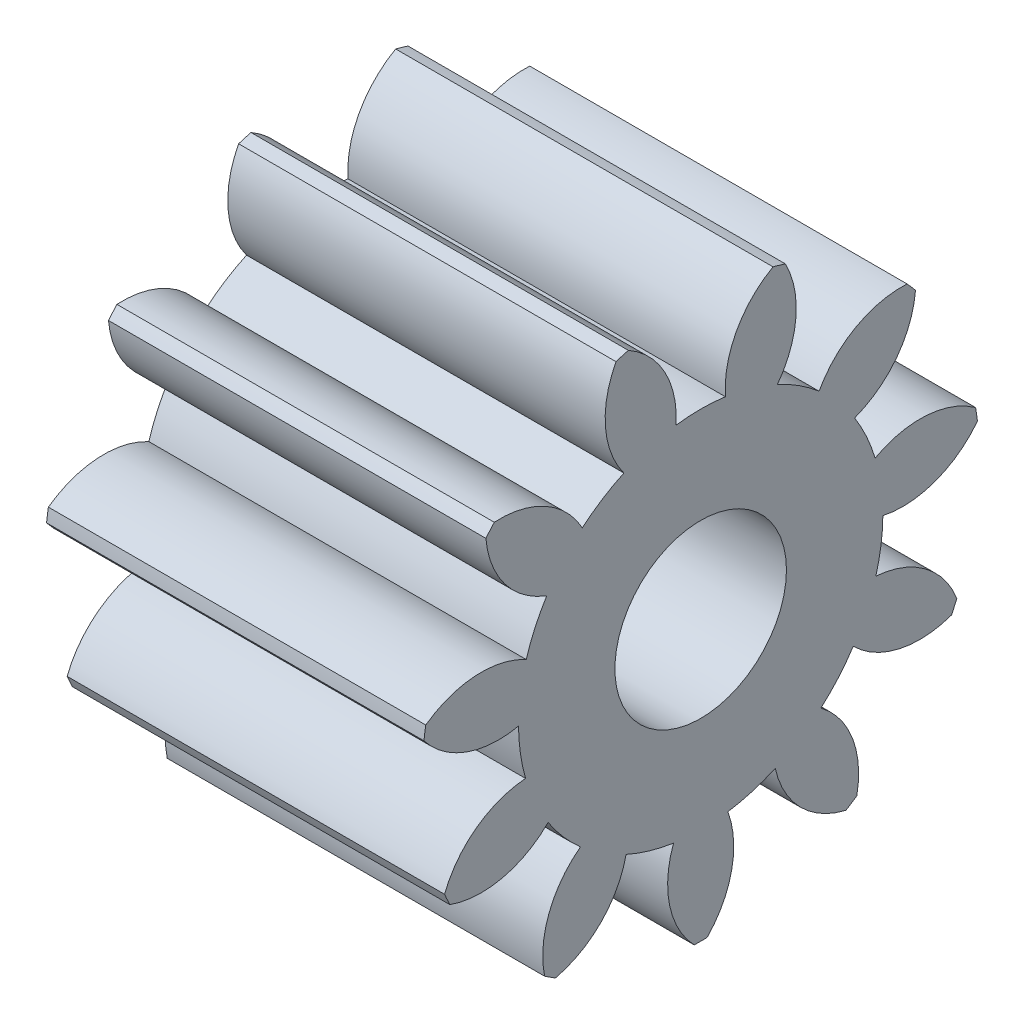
ISO-10303-21;
HEADER;
FILE_DESCRIPTION(('STEP AP214'),'2;1');
FILE_NAME('part.step','',(''),(''),'','','');
FILE_SCHEMA(('AUTOMOTIVE_DESIGN { 1 0 10303 214 1 1 1 1 }'));
ENDSEC;
DATA;
#1=APPLICATION_CONTEXT('core data for automotive mechanical design processes');
#2=APPLICATION_PROTOCOL_DEFINITION('international standard','automotive_design',2000,#1);
#3=PRODUCT_CONTEXT('',#1,'mechanical');
#4=PRODUCT('Part','Part','',(#3));
#5=PRODUCT_RELATED_PRODUCT_CATEGORY('part','',(#4));
#6=PRODUCT_DEFINITION_FORMATION('','',#4);
#7=PRODUCT_DEFINITION_CONTEXT('part definition',#1,'design');
#8=PRODUCT_DEFINITION('design','',#6,#7);
#9=PRODUCT_DEFINITION_SHAPE('','',#8);
#10=(LENGTH_UNIT() NAMED_UNIT(*) SI_UNIT(.MILLI.,.METRE.));
#11=(NAMED_UNIT(*) PLANE_ANGLE_UNIT() SI_UNIT($,.RADIAN.));
#12=(NAMED_UNIT(*) SI_UNIT($,.STERADIAN.) SOLID_ANGLE_UNIT());
#13=UNCERTAINTY_MEASURE_WITH_UNIT(LENGTH_MEASURE(1.E-05),#10,'distance_accuracy_value','');
#14=(GEOMETRIC_REPRESENTATION_CONTEXT(3) GLOBAL_UNCERTAINTY_ASSIGNED_CONTEXT((#13)) GLOBAL_UNIT_ASSIGNED_CONTEXT((#10,
#11,#12)) REPRESENTATION_CONTEXT('',''));
#15=CARTESIAN_POINT('',(0.,0.,0.));
#16=DIRECTION('',(0.,0.,1.));
#17=DIRECTION('',(1.,0.,0.));
#18=AXIS2_PLACEMENT_3D('',#15,#16,#17);
#19=CARTESIAN_POINT('',(0.,0.,0.));
#20=DIRECTION('',(1.,0.,0.));
#21=DIRECTION('',(0.,0.,-1.));
#22=AXIS2_PLACEMENT_3D('',#19,#20,#21);
#23=PLANE('',#22);
#24=CARTESIAN_POINT('',(0.,1.08615674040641,-2.34480683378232));
#25=DIRECTION('',(-1.,0.,0.));
#26=DIRECTION('',(0.,-0.540640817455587,-0.841253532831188));
#27=AXIS2_PLACEMENT_3D('',#24,#25,#26);
#28=CIRCLE('',#27,1.1);
#29=CARTESIAN_POINT('',(0.,1.61457750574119,-1.38004183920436));
#30=VERTEX_POINT('',#29);
#31=CARTESIAN_POINT('',(0.,2.18443096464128,-2.40640008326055));
#32=VERTEX_POINT('',#31);
#33=EDGE_CURVE('E43',#30,#32,#28,.T.);
#34=ORIENTED_EDGE('',*,*,#33,.T.);
#35=CARTESIAN_POINT('',(0.,0.,0.));
#36=DIRECTION('',(-1.,0.,0.));
#37=DIRECTION('',(0.,0.,1.));
#38=AXIS2_PLACEMENT_3D('',#35,#36,#37);
#39=CIRCLE('',#38,3.25);
#40=CARTESIAN_POINT('',(0.,2.07102946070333,-2.50466304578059));
#41=VERTEX_POINT('',#40);
#42=EDGE_CURVE('E314',#32,#41,#39,.T.);
#43=ORIENTED_EDGE('',*,*,#42,.T.);
#44=CARTESIAN_POINT('',(0.,2.16636386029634,-1.40880203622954));
#45=DIRECTION('',(1.,0.,0.));
#46=DIRECTION('',(0.,0.,-1.));
#47=AXIS2_PLACEMENT_3D('',#44,#45,#46);
#48=CIRCLE('',#47,1.1);
#49=CARTESIAN_POINT('',(0.,1.13621666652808,-1.79454386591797));
#50=VERTEX_POINT('',#49);
#51=EDGE_CURVE('E36',#50,#41,#48,.T.);
#52=ORIENTED_EDGE('',*,*,#51,.F.);
#53=CARTESIAN_POINT('',(0.,0.,0.));
#54=DIRECTION('',(-1.,0.,0.));
#55=DIRECTION('',(0.,-0.909631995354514,-0.415415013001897));
#56=AXIS2_PLACEMENT_3D('',#53,#54,#55);
#57=CIRCLE('',#56,2.124);
#58=CARTESIAN_POINT('',(0.,0.612162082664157,-2.03387157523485));
#59=VERTEX_POINT('',#58);
#60=EDGE_CURVE('E467',#50,#59,#57,.T.);
#61=ORIENTED_EDGE('',*,*,#60,.T.);
#62=CARTESIAN_POINT('',(0.,-0.353965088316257,-2.5597977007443));
#63=DIRECTION('',(-1.,0.,0.));
#64=DIRECTION('',(0.,-0.909631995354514,-0.415415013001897));
#65=AXIS2_PLACEMENT_3D('',#62,#63,#64);
#66=CIRCLE('',#65,1.1);
#67=CARTESIAN_POINT('',(0.,0.536662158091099,-3.20538511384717));
#68=VERTEX_POINT('',#67);
#69=EDGE_CURVE('E51',#59,#68,#66,.T.);
#70=ORIENTED_EDGE('',*,*,#69,.T.);
#71=CARTESIAN_POINT('',(0.,0.388137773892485,-3.2267396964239));
#72=VERTEX_POINT('',#71);
#73=EDGE_CURVE('E651',#68,#72,#39,.T.);
#74=ORIENTED_EDGE('',*,*,#73,.T.);
#75=CARTESIAN_POINT('',(0.,1.06080536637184,-2.35638441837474));
#76=DIRECTION('',(1.,0.,0.));
#77=DIRECTION('',(0.,0.,-1.));
#78=AXIS2_PLACEMENT_3D('',#75,#76,#77);
#79=CIRCLE('',#78,1.1);
#80=CARTESIAN_POINT('',(0.,-0.014357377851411,-2.12395147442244));
#81=VERTEX_POINT('',#80);
#82=EDGE_CURVE('E641',#81,#72,#79,.T.);
#83=ORIENTED_EDGE('',*,*,#82,.F.);
#84=CARTESIAN_POINT('',(0.,0.,0.));
#85=DIRECTION('',(-1.,0.,0.));
#86=DIRECTION('',(0.,-0.989821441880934,0.142314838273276));
#87=AXIS2_PLACEMENT_3D('',#84,#85,#86);
#88=CIRCLE('',#87,2.124);
#89=CARTESIAN_POINT('',(0.,-0.584610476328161,-2.04196145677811));
#90=VERTEX_POINT('',#89);
#91=EDGE_CURVE('E481',#81,#90,#88,.T.);
#92=ORIENTED_EDGE('',*,*,#91,.T.);
#93=CARTESIAN_POINT('',(0.,-1.68170550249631,-1.96207088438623));
#94=DIRECTION('',(-1.,0.,0.));
#95=DIRECTION('',(0.,-0.989821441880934,0.142314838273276));
#96=AXIS2_PLACEMENT_3D('',#93,#94,#95);
#97=CIRCLE('',#96,1.1);
#98=CARTESIAN_POINT('',(0.,-1.2814930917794,-2.98668301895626));
#99=VERTEX_POINT('',#98);
#100=EDGE_CURVE('E478',#90,#99,#97,.T.);
#101=ORIENTED_EDGE('',*,*,#100,.T.);
#102=CARTESIAN_POINT('',(0.,-1.41798491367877,-2.92434929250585));
#103=VERTEX_POINT('',#102);
#104=EDGE_CURVE('E652',#99,#103,#39,.T.);
#105=ORIENTED_EDGE('',*,*,#104,.T.);
#106=CARTESIAN_POINT('',(0.,-0.381551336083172,-2.55583139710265));
#107=DIRECTION('',(1.,0.,0.));
#108=DIRECTION('',(0.,0.,-1.));
#109=AXIS2_PLACEMENT_3D('',#106,#107,#108);
#110=CIRCLE('',#109,1.1);
#111=CARTESIAN_POINT('',(0.,-1.16037305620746,-1.77901949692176));
#112=VERTEX_POINT('',#111);
#113=EDGE_CURVE('E638',#112,#103,#110,.T.);
#114=ORIENTED_EDGE('',*,*,#113,.F.);
#115=CARTESIAN_POINT('',(0.,0.,0.));
#116=DIRECTION('',(-1.,0.,0.));
#117=DIRECTION('',(0.,-0.755749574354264,0.654860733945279));
#118=AXIS2_PLACEMENT_3D('',#115,#116,#117);
#119=CIRCLE('',#118,2.124);
#120=CARTESIAN_POINT('',(0.,-1.59577333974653,-1.40174300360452));
#121=VERTEX_POINT('',#120);
#122=EDGE_CURVE('E496',#112,#121,#119,.T.);
#123=ORIENTED_EDGE('',*,*,#122,.T.);
#124=CARTESIAN_POINT('',(0.,-2.47551630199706,-0.74140042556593));
#125=DIRECTION('',(-1.,0.,0.));
#126=DIRECTION('',(0.,-0.755749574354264,0.654860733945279));
#127=AXIS2_PLACEMENT_3D('',#124,#125,#126);
#128=CIRCLE('',#127,1.1);
#129=CARTESIAN_POINT('',(0.,-2.69278333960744,-1.81973016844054));
#130=VERTEX_POINT('',#129);
#131=EDGE_CURVE('E493',#121,#130,#128,.T.);
#132=ORIENTED_EDGE('',*,*,#131,.T.);
#133=CARTESIAN_POINT('',(0.,-2.77390741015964,-1.69349865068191));
#134=VERTEX_POINT('',#133);
#135=EDGE_CURVE('E655',#130,#134,#39,.T.);
#136=ORIENTED_EDGE('',*,*,#135,.T.);
#137=CARTESIAN_POINT('',(0.,-1.70276818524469,-1.94381996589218));
#138=DIRECTION('',(1.,0.,0.));
#139=DIRECTION('',(0.,0.,-1.));
#140=AXIS2_PLACEMENT_3D('',#137,#138,#139);
#141=CIRCLE('',#140,1.1);
#142=CARTESIAN_POINT('',(0.,-1.93797848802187,-0.86926139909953));
#143=VERTEX_POINT('',#142);
#144=EDGE_CURVE('E635',#143,#134,#141,.T.);
#145=ORIENTED_EDGE('',*,*,#144,.F.);
#146=CARTESIAN_POINT('',(0.,0.,0.));
#147=DIRECTION('',(-1.,0.,0.));
#148=DIRECTION('',(0.,-0.281732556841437,0.959492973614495));
#149=AXIS2_PLACEMENT_3D('',#146,#147,#148);
#150=CIRCLE('',#149,2.124);
#151=CARTESIAN_POINT('',(0.,-2.10028944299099,-0.316481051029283));
#152=VERTEX_POINT('',#151);
#153=EDGE_CURVE('E511',#143,#152,#150,.T.);
#154=ORIENTED_EDGE('',*,*,#153,.T.);
#155=CARTESIAN_POINT('',(0.,-2.4833681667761,0.714659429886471));
#156=DIRECTION('',(-1.,0.,0.));
#157=DIRECTION('',(0.,-0.281732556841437,0.959492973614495));
#158=AXIS2_PLACEMENT_3D('',#155,#156,#157);
#159=CIRCLE('',#158,1.1);
#160=CARTESIAN_POINT('',(0.,-3.24913390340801,-0.0750258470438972));
#161=VERTEX_POINT('',#160);
#162=EDGE_CURVE('E508',#152,#161,#159,.T.);
#163=ORIENTED_EDGE('',*,*,#162,.T.);
#164=CARTESIAN_POINT('',(0.,-3.24913390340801,0.075025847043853));
#165=VERTEX_POINT('',#164);
#166=EDGE_CURVE('E658',#161,#165,#39,.T.);
#167=ORIENTED_EDGE('',*,*,#166,.T.);
#168=CARTESIAN_POINT('',(0.,-2.48336816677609,-0.714659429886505));
#169=DIRECTION('',(1.,0.,0.));
#170=DIRECTION('',(0.,0.,-1.));
#171=AXIS2_PLACEMENT_3D('',#168,#169,#170);
#172=CIRCLE('',#171,1.1);
#173=CARTESIAN_POINT('',(0.,-2.100289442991,0.316481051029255));
#174=VERTEX_POINT('',#173);
#175=EDGE_CURVE('E632',#174,#165,#172,.T.);
#176=ORIENTED_EDGE('',*,*,#175,.F.);
#177=CARTESIAN_POINT('',(0.,0.,0.));
#178=DIRECTION('',(-1.,0.,0.));
#179=DIRECTION('',(0.,0.281732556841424,0.959492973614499));
#180=AXIS2_PLACEMENT_3D('',#177,#178,#179);
#181=CIRCLE('',#180,2.124);
#182=CARTESIAN_POINT('',(0.,-1.93797848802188,0.869261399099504));
#183=VERTEX_POINT('',#182);
#184=EDGE_CURVE('E526',#174,#183,#181,.T.);
#185=ORIENTED_EDGE('',*,*,#184,.T.);
#186=CARTESIAN_POINT('',(0.,-1.70276818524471,1.94381996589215));
#187=DIRECTION('',(-1.,0.,0.));
#188=DIRECTION('',(0.,0.281732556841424,0.959492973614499));
#189=AXIS2_PLACEMENT_3D('',#186,#187,#188);
#190=CIRCLE('',#189,1.1);
#191=CARTESIAN_POINT('',(0.,-2.77390741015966,1.69349865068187));
#192=VERTEX_POINT('',#191);
#193=EDGE_CURVE('E523',#183,#192,#190,.T.);
#194=ORIENTED_EDGE('',*,*,#193,.T.);
#195=CARTESIAN_POINT('',(0.,-2.69278333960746,1.8197301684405));
#196=VERTEX_POINT('',#195);
#197=EDGE_CURVE('E661',#192,#196,#39,.T.);
#198=ORIENTED_EDGE('',*,*,#197,.T.);
#199=CARTESIAN_POINT('',(0.,-2.47551630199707,0.741400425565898));
#200=DIRECTION('',(1.,0.,0.));
#201=DIRECTION('',(0.,0.,-1.));
#202=AXIS2_PLACEMENT_3D('',#199,#200,#201);
#203=CIRCLE('',#202,1.1);
#204=CARTESIAN_POINT('',(0.,-1.59577333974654,1.4017430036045));
#205=VERTEX_POINT('',#204);
#206=EDGE_CURVE('E629',#205,#196,#203,.T.);
#207=ORIENTED_EDGE('',*,*,#206,.F.);
#208=CARTESIAN_POINT('',(0.,0.,0.));
#209=DIRECTION('',(-1.,0.,0.));
#210=DIRECTION('',(0.,0.755749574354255,0.654860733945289));
#211=AXIS2_PLACEMENT_3D('',#208,#209,#210);
#212=CIRCLE('',#211,2.124);
#213=CARTESIAN_POINT('',(0.,-1.16037305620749,1.77901949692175));
#214=VERTEX_POINT('',#213);
#215=EDGE_CURVE('E541',#205,#214,#212,.T.);
#216=ORIENTED_EDGE('',*,*,#215,.T.);
#217=CARTESIAN_POINT('',(0.,-0.381551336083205,2.55583139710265));
#218=DIRECTION('',(-1.,0.,0.));
#219=DIRECTION('',(0.,0.755749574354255,0.654860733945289));
#220=AXIS2_PLACEMENT_3D('',#217,#218,#219);
#221=CIRCLE('',#220,1.1);
#222=CARTESIAN_POINT('',(0.,-1.4179849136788,2.92434929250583));
#223=VERTEX_POINT('',#222);
#224=EDGE_CURVE('E538',#214,#223,#221,.T.);
#225=ORIENTED_EDGE('',*,*,#224,.T.);
#226=CARTESIAN_POINT('',(0.,-1.28149309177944,2.98668301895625));
#227=VERTEX_POINT('',#226);
#228=EDGE_CURVE('E664',#223,#227,#39,.T.);
#229=ORIENTED_EDGE('',*,*,#228,.T.);
#230=CARTESIAN_POINT('',(0.,-1.68170550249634,1.96207088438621));
#231=DIRECTION('',(1.,0.,0.));
#232=DIRECTION('',(0.,0.,-1.));
#233=AXIS2_PLACEMENT_3D('',#230,#231,#232);
#234=CIRCLE('',#233,1.1);
#235=CARTESIAN_POINT('',(0.,-0.584610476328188,2.0419614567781));
#236=VERTEX_POINT('',#235);
#237=EDGE_CURVE('E626',#236,#227,#234,.T.);
#238=ORIENTED_EDGE('',*,*,#237,.F.);
#239=CARTESIAN_POINT('',(0.,0.,0.));
#240=DIRECTION('',(-1.,0.,0.));
#241=DIRECTION('',(0.,0.989821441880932,0.142314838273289));
#242=AXIS2_PLACEMENT_3D('',#239,#240,#241);
#243=CIRCLE('',#242,2.124);
#244=CARTESIAN_POINT('',(0.,-0.0143573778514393,2.12395147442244));
#245=VERTEX_POINT('',#244);
#246=EDGE_CURVE('E556',#236,#245,#243,.T.);
#247=ORIENTED_EDGE('',*,*,#246,.T.);
#248=CARTESIAN_POINT('',(0.,1.06080536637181,2.35638441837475));
#249=DIRECTION('',(-1.,0.,0.));
#250=DIRECTION('',(0.,0.989821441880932,0.142314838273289));
#251=AXIS2_PLACEMENT_3D('',#248,#249,#250);
#252=CIRCLE('',#251,1.1);
#253=CARTESIAN_POINT('',(0.,0.388137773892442,3.22673969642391));
#254=VERTEX_POINT('',#253);
#255=EDGE_CURVE('E553',#245,#254,#252,.T.);
#256=ORIENTED_EDGE('',*,*,#255,.T.);
#257=CARTESIAN_POINT('',(0.,0.536662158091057,3.20538511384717));
#258=VERTEX_POINT('',#257);
#259=EDGE_CURVE('E667',#254,#258,#39,.T.);
#260=ORIENTED_EDGE('',*,*,#259,.T.);
#261=CARTESIAN_POINT('',(0.,-0.353965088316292,2.5597977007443));
#262=DIRECTION('',(1.,0.,0.));
#263=DIRECTION('',(0.,0.,-1.));
#264=AXIS2_PLACEMENT_3D('',#261,#262,#263);
#265=CIRCLE('',#264,1.1);
#266=CARTESIAN_POINT('',(0.,0.61216208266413,2.03387157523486));
#267=VERTEX_POINT('',#266);
#268=EDGE_CURVE('E623',#267,#258,#265,.T.);
#269=ORIENTED_EDGE('',*,*,#268,.F.);
#270=CARTESIAN_POINT('',(0.,0.,0.));
#271=DIRECTION('',(-1.,0.,0.));
#272=DIRECTION('',(0.,0.90963199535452,-0.415415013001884));
#273=AXIS2_PLACEMENT_3D('',#270,#271,#272);
#274=CIRCLE('',#273,2.124);
#275=CARTESIAN_POINT('',(0.,1.13621666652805,1.79454386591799));
#276=VERTEX_POINT('',#275);
#277=EDGE_CURVE('E571',#267,#276,#274,.T.);
#278=ORIENTED_EDGE('',*,*,#277,.T.);
#279=CARTESIAN_POINT('',(0.,2.16636386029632,1.40880203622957));
#280=DIRECTION('',(-1.,0.,0.));
#281=DIRECTION('',(0.,0.90963199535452,-0.415415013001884));
#282=AXIS2_PLACEMENT_3D('',#279,#280,#281);
#283=CIRCLE('',#282,1.1);
#284=CARTESIAN_POINT('',(0.,2.0710294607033,2.50466304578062));
#285=VERTEX_POINT('',#284);
#286=EDGE_CURVE('E568',#276,#285,#283,.T.);
#287=ORIENTED_EDGE('',*,*,#286,.T.);
#288=CARTESIAN_POINT('',(0.,2.18443096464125,2.40640008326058));
#289=VERTEX_POINT('',#288);
#290=EDGE_CURVE('E670',#285,#289,#39,.T.);
#291=ORIENTED_EDGE('',*,*,#290,.T.);
#292=CARTESIAN_POINT('',(0.,1.08615674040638,2.34480683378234));
#293=DIRECTION('',(1.,0.,0.));
#294=DIRECTION('',(0.,0.,-1.));
#295=AXIS2_PLACEMENT_3D('',#292,#293,#294);
#296=CIRCLE('',#295,1.1);
#297=CARTESIAN_POINT('',(0.,1.61457750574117,1.38004183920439));
#298=VERTEX_POINT('',#297);
#299=EDGE_CURVE('E620',#298,#289,#296,.T.);
#300=ORIENTED_EDGE('',*,*,#299,.F.);
#301=CARTESIAN_POINT('',(0.,0.,0.));
#302=DIRECTION('',(-1.,0.,0.));
#303=DIRECTION('',(0.,0.540640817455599,-0.841253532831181));
#304=AXIS2_PLACEMENT_3D('',#301,#302,#303);
#305=CIRCLE('',#304,2.124);
#306=CARTESIAN_POINT('',(0.,1.92604994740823,0.895381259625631));
#307=VERTEX_POINT('',#306);
#308=EDGE_CURVE('E586',#298,#307,#305,.T.);
#309=ORIENTED_EDGE('',*,*,#308,.T.);
#310=CARTESIAN_POINT('',(0.,2.58411713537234,0.013934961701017));
#311=DIRECTION('',(-1.,0.,0.));
#312=DIRECTION('',(0.,0.540640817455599,-0.841253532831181));
#313=AXIS2_PLACEMENT_3D('',#310,#311,#312);
#314=CIRCLE('',#313,1.1);
#315=CARTESIAN_POINT('',(0.,3.09638392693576,0.98737357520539));
#316=VERTEX_POINT('',#315);
#317=EDGE_CURVE('E583',#307,#316,#314,.T.);
#318=ORIENTED_EDGE('',*,*,#317,.T.);
#319=CARTESIAN_POINT('',(0.,3.13865837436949,0.843400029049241));
#320=VERTEX_POINT('',#319);
#321=EDGE_CURVE('E613',#316,#320,#39,.T.);
#322=ORIENTED_EDGE('',*,*,#321,.T.);
#323=CARTESIAN_POINT('',(0.,2.18143147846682,1.38535636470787));
#324=DIRECTION('',(1.,0.,0.));
#325=DIRECTION('',(0.,0.,-1.));
#326=AXIS2_PLACEMENT_3D('',#323,#324,#325);
#327=CIRCLE('',#326,1.1);
#328=CARTESIAN_POINT('',(0.,2.1043759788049,0.288058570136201));
#329=VERTEX_POINT('',#328);
#330=EDGE_CURVE('E617',#329,#320,#327,.T.);
#331=ORIENTED_EDGE('',*,*,#330,.F.);
#332=CARTESIAN_POINT('',(0.,0.,0.));
#333=DIRECTION('',(-1.,0.,0.));
#334=DIRECTION('',(0.,0.,-1.));
#335=AXIS2_PLACEMENT_3D('',#332,#333,#334);
#336=CIRCLE('',#335,2.124);
#337=CARTESIAN_POINT('',(0.,2.1043759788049,-0.288058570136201));
#338=VERTEX_POINT('',#337);
#339=EDGE_CURVE('E601',#329,#338,#336,.T.);
#340=ORIENTED_EDGE('',*,*,#339,.T.);
#341=CARTESIAN_POINT('',(0.,2.18143147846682,-1.38535636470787));
#342=DIRECTION('',(-1.,0.,0.));
#343=DIRECTION('',(0.,0.,-1.));
#344=AXIS2_PLACEMENT_3D('',#341,#342,#343);
#345=CIRCLE('',#344,1.1);
#346=CARTESIAN_POINT('',(0.,3.13865837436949,-0.843400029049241));
#347=VERTEX_POINT('',#346);
#348=EDGE_CURVE('E598',#338,#347,#345,.T.);
#349=ORIENTED_EDGE('',*,*,#348,.T.);
#350=CARTESIAN_POINT('',(0.,3.09638392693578,-0.987373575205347));
#351=VERTEX_POINT('',#350);
#352=EDGE_CURVE('E614',#347,#351,#39,.T.);
#353=ORIENTED_EDGE('',*,*,#352,.T.);
#354=CARTESIAN_POINT('',(0.,2.58411713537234,-0.0139349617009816));
#355=DIRECTION('',(1.,0.,0.));
#356=DIRECTION('',(0.,0.,-1.));
#357=AXIS2_PLACEMENT_3D('',#354,#355,#356);
#358=CIRCLE('',#357,1.1);
#359=CARTESIAN_POINT('',(0.,1.92604994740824,-0.895381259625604));
#360=VERTEX_POINT('',#359);
#361=EDGE_CURVE('E11',#360,#351,#358,.T.);
#362=ORIENTED_EDGE('',*,*,#361,.F.);
#363=CARTESIAN_POINT('',(0.,0.,0.));
#364=DIRECTION('',(-1.,0.,0.));
#365=DIRECTION('',(0.,-0.540640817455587,-0.841253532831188));
#366=AXIS2_PLACEMENT_3D('',#363,#364,#365);
#367=CIRCLE('',#366,2.124);
#368=EDGE_CURVE('E459',#360,#30,#367,.T.);
#369=ORIENTED_EDGE('',*,*,#368,.T.);
#370=EDGE_LOOP('',(#34,#43,#52,#61,#70,#74,#83,#92,#101,#105,#114,#123,#132,#136,#145,#154,#163,
#167,#176,#185,#194,#198,#207,#216,#225,#229,#238,#247,#256,#260,#269,#278,#287,#291,#300,#309,
#318,#322,#331,#340,#349,#353,#362,#369));
#371=FACE_BOUND('',#370,.T.);
#372=CARTESIAN_POINT('',(0.,0.,0.));
#373=DIRECTION('',(1.,0.,0.));
#374=DIRECTION('',(0.,0.,-1.));
#375=AXIS2_PLACEMENT_3D('',#372,#373,#374);
#376=CIRCLE('',#375,0.999999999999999);
#377=CARTESIAN_POINT('',(0.,0.,-0.999999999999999));
#378=VERTEX_POINT('',#377);
#379=EDGE_CURVE('E31',#378,#378,#376,.F.);
#380=ORIENTED_EDGE('',*,*,#379,.F.);
#381=EDGE_LOOP('',(#380));
#382=FACE_BOUND('',#381,.T.);
#383=ADVANCED_FACE('F27',(#371,#382),#23,.F.);
#384=CARTESIAN_POINT('',(-10.,0.,0.));
#385=DIRECTION('',(-1.,0.,0.));
#386=DIRECTION('',(0.,0.,1.));
#387=AXIS2_PLACEMENT_3D('',#384,#385,#386);
#388=CYLINDRICAL_SURFACE('',#387,3.25);
#389=DIRECTION('',(-1.,0.,0.));
#390=VECTOR('',#389,1.);
#391=CARTESIAN_POINT('',(2.05,2.18443096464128,-2.40640008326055));
#392=LINE('',#391,#390);
#393=CARTESIAN_POINT('',(4.4,2.18443096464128,-2.40640008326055));
#394=VERTEX_POINT('',#393);
#395=EDGE_CURVE('E308',#394,#32,#392,.T.);
#396=ORIENTED_EDGE('',*,*,#395,.F.);
#397=CARTESIAN_POINT('',(4.4,0.,0.));
#398=DIRECTION('',(1.,0.,0.));
#399=DIRECTION('',(0.,0.,-1.));
#400=AXIS2_PLACEMENT_3D('',#397,#398,#399);
#401=CIRCLE('',#400,3.25);
#402=CARTESIAN_POINT('',(4.4,2.07102946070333,-2.50466304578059));
#403=VERTEX_POINT('',#402);
#404=EDGE_CURVE('E313',#403,#394,#401,.T.);
#405=ORIENTED_EDGE('',*,*,#404,.F.);
#406=DIRECTION('',(-1.,0.,0.));
#407=VECTOR('',#406,1.);
#408=CARTESIAN_POINT('',(2.05,2.07102946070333,-2.50466304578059));
#409=LINE('',#408,#407);
#410=EDGE_CURVE('E474',#41,#403,#409,.F.);
#411=ORIENTED_EDGE('',*,*,#410,.F.);
#412=ORIENTED_EDGE('',*,*,#42,.F.);
#413=EDGE_LOOP('',(#396,#405,#411,#412));
#414=FACE_BOUND('',#413,.T.);
#415=ADVANCED_FACE('F310',(#414),#388,.T.);
#416=DIRECTION('',(-1.,0.,0.));
#417=VECTOR('',#416,1.);
#418=CARTESIAN_POINT('',(2.05,3.09638392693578,-0.987373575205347));
#419=LINE('',#418,#417);
#420=CARTESIAN_POINT('',(4.4,3.09638392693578,-0.987373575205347));
#421=VERTEX_POINT('',#420);
#422=EDGE_CURVE('E315',#351,#421,#419,.F.);
#423=ORIENTED_EDGE('',*,*,#422,.F.);
#424=ORIENTED_EDGE('',*,*,#352,.F.);
#425=DIRECTION('',(-1.,0.,0.));
#426=VECTOR('',#425,1.);
#427=CARTESIAN_POINT('',(2.05,3.13865837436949,-0.843400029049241));
#428=LINE('',#427,#426);
#429=CARTESIAN_POINT('',(4.4,3.13865837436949,-0.843400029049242));
#430=VERTEX_POINT('',#429);
#431=EDGE_CURVE('E611',#430,#347,#428,.T.);
#432=ORIENTED_EDGE('',*,*,#431,.F.);
#433=CARTESIAN_POINT('',(4.4,0.,0.));
#434=DIRECTION('',(1.,0.,0.));
#435=DIRECTION('',(0.,0.,-1.));
#436=AXIS2_PLACEMENT_3D('',#433,#434,#435);
#437=CIRCLE('',#436,3.25);
#438=EDGE_CURVE('E341',#421,#430,#437,.T.);
#439=ORIENTED_EDGE('',*,*,#438,.F.);
#440=EDGE_LOOP('',(#423,#424,#432,#439));
#441=FACE_BOUND('',#440,.T.);
#442=ADVANCED_FACE('F814',(#441),#388,.T.);
#443=DIRECTION('',(-1.,0.,0.));
#444=VECTOR('',#443,1.);
#445=CARTESIAN_POINT('',(2.05,0.5366621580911,-3.20538511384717));
#446=LINE('',#445,#444);
#447=CARTESIAN_POINT('',(4.4,0.536662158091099,-3.20538511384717));
#448=VERTEX_POINT('',#447);
#449=EDGE_CURVE('E476',#448,#68,#446,.T.);
#450=ORIENTED_EDGE('',*,*,#449,.F.);
#451=CARTESIAN_POINT('',(4.4,0.,0.));
#452=DIRECTION('',(1.,0.,0.));
#453=DIRECTION('',(0.,0.,-1.));
#454=AXIS2_PLACEMENT_3D('',#451,#452,#453);
#455=CIRCLE('',#454,3.25);
#456=CARTESIAN_POINT('',(4.4,0.388137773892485,-3.2267396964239));
#457=VERTEX_POINT('',#456);
#458=EDGE_CURVE('E449',#457,#448,#455,.T.);
#459=ORIENTED_EDGE('',*,*,#458,.F.);
#460=DIRECTION('',(-1.,0.,0.));
#461=VECTOR('',#460,1.);
#462=CARTESIAN_POINT('',(2.05,0.388137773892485,-3.2267396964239));
#463=LINE('',#462,#461);
#464=EDGE_CURVE('E489',#72,#457,#463,.F.);
#465=ORIENTED_EDGE('',*,*,#464,.F.);
#466=ORIENTED_EDGE('',*,*,#73,.F.);
#467=EDGE_LOOP('',(#450,#459,#465,#466));
#468=FACE_BOUND('',#467,.T.);
#469=ADVANCED_FACE('F795',(#468),#388,.T.);
#470=DIRECTION('',(-1.,0.,0.));
#471=VECTOR('',#470,1.);
#472=CARTESIAN_POINT('',(2.05,-1.2814930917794,-2.98668301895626));
#473=LINE('',#472,#471);
#474=CARTESIAN_POINT('',(4.4,-1.2814930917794,-2.98668301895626));
#475=VERTEX_POINT('',#474);
#476=EDGE_CURVE('E491',#475,#99,#473,.T.);
#477=ORIENTED_EDGE('',*,*,#476,.F.);
#478=CARTESIAN_POINT('',(4.4,0.,0.));
#479=DIRECTION('',(1.,0.,0.));
#480=DIRECTION('',(0.,0.,-1.));
#481=AXIS2_PLACEMENT_3D('',#478,#479,#480);
#482=CIRCLE('',#481,3.25);
#483=CARTESIAN_POINT('',(4.4,-1.41798491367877,-2.92434929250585));
#484=VERTEX_POINT('',#483);
#485=EDGE_CURVE('E437',#484,#475,#482,.T.);
#486=ORIENTED_EDGE('',*,*,#485,.F.);
#487=DIRECTION('',(-1.,0.,0.));
#488=VECTOR('',#487,1.);
#489=CARTESIAN_POINT('',(2.05,-1.41798491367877,-2.92434929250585));
#490=LINE('',#489,#488);
#491=EDGE_CURVE('E504',#103,#484,#490,.F.);
#492=ORIENTED_EDGE('',*,*,#491,.F.);
#493=ORIENTED_EDGE('',*,*,#104,.F.);
#494=EDGE_LOOP('',(#477,#486,#492,#493));
#495=FACE_BOUND('',#494,.T.);
#496=ADVANCED_FACE('F781',(#495),#388,.T.);
#497=DIRECTION('',(-1.,0.,0.));
#498=VECTOR('',#497,1.);
#499=CARTESIAN_POINT('',(2.05,-2.69278333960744,-1.81973016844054));
#500=LINE('',#499,#498);
#501=CARTESIAN_POINT('',(4.4,-2.69278333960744,-1.81973016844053));
#502=VERTEX_POINT('',#501);
#503=EDGE_CURVE('E506',#502,#130,#500,.T.);
#504=ORIENTED_EDGE('',*,*,#503,.F.);
#505=CARTESIAN_POINT('',(4.4,0.,0.));
#506=DIRECTION('',(1.,0.,0.));
#507=DIRECTION('',(0.,0.,-1.));
#508=AXIS2_PLACEMENT_3D('',#505,#506,#507);
#509=CIRCLE('',#508,3.25);
#510=CARTESIAN_POINT('',(4.4,-2.77390741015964,-1.69349865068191));
#511=VERTEX_POINT('',#510);
#512=EDGE_CURVE('E425',#511,#502,#509,.T.);
#513=ORIENTED_EDGE('',*,*,#512,.F.);
#514=DIRECTION('',(-1.,0.,0.));
#515=VECTOR('',#514,1.);
#516=CARTESIAN_POINT('',(2.05,-2.77390741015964,-1.69349865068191));
#517=LINE('',#516,#515);
#518=EDGE_CURVE('E519',#134,#511,#517,.F.);
#519=ORIENTED_EDGE('',*,*,#518,.F.);
#520=ORIENTED_EDGE('',*,*,#135,.F.);
#521=EDGE_LOOP('',(#504,#513,#519,#520));
#522=FACE_BOUND('',#521,.T.);
#523=ADVANCED_FACE('F767',(#522),#388,.T.);
#524=DIRECTION('',(-1.,0.,0.));
#525=VECTOR('',#524,1.);
#526=CARTESIAN_POINT('',(2.05,-3.24913390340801,-0.0750258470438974));
#527=LINE('',#526,#525);
#528=CARTESIAN_POINT('',(4.4,-3.24913390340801,-0.0750258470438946));
#529=VERTEX_POINT('',#528);
#530=EDGE_CURVE('E521',#529,#161,#527,.T.);
#531=ORIENTED_EDGE('',*,*,#530,.F.);
#532=CARTESIAN_POINT('',(4.4,0.,0.));
#533=DIRECTION('',(1.,0.,0.));
#534=DIRECTION('',(0.,0.,-1.));
#535=AXIS2_PLACEMENT_3D('',#532,#533,#534);
#536=CIRCLE('',#535,3.25);
#537=CARTESIAN_POINT('',(4.4,-3.24913390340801,0.0750258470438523));
#538=VERTEX_POINT('',#537);
#539=EDGE_CURVE('E413',#538,#529,#536,.T.);
#540=ORIENTED_EDGE('',*,*,#539,.F.);
#541=DIRECTION('',(-1.,0.,0.));
#542=VECTOR('',#541,1.);
#543=CARTESIAN_POINT('',(2.05,-3.24913390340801,0.0750258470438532));
#544=LINE('',#543,#542);
#545=EDGE_CURVE('E534',#165,#538,#544,.F.);
#546=ORIENTED_EDGE('',*,*,#545,.F.);
#547=ORIENTED_EDGE('',*,*,#166,.F.);
#548=EDGE_LOOP('',(#531,#540,#546,#547));
#549=FACE_BOUND('',#548,.T.);
#550=ADVANCED_FACE('F753',(#549),#388,.T.);
#551=DIRECTION('',(-1.,0.,0.));
#552=VECTOR('',#551,1.);
#553=CARTESIAN_POINT('',(2.05,-2.77390741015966,1.69349865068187));
#554=LINE('',#553,#552);
#555=CARTESIAN_POINT('',(4.4,-2.77390741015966,1.69349865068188));
#556=VERTEX_POINT('',#555);
#557=EDGE_CURVE('E536',#556,#192,#554,.T.);
#558=ORIENTED_EDGE('',*,*,#557,.F.);
#559=CARTESIAN_POINT('',(4.4,0.,0.));
#560=DIRECTION('',(1.,0.,0.));
#561=DIRECTION('',(0.,0.,-1.));
#562=AXIS2_PLACEMENT_3D('',#559,#560,#561);
#563=CIRCLE('',#562,3.25);
#564=CARTESIAN_POINT('',(4.4,-2.69278333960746,1.8197301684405));
#565=VERTEX_POINT('',#564);
#566=EDGE_CURVE('E401',#565,#556,#563,.T.);
#567=ORIENTED_EDGE('',*,*,#566,.F.);
#568=DIRECTION('',(-1.,0.,0.));
#569=VECTOR('',#568,1.);
#570=CARTESIAN_POINT('',(2.05,-2.69278333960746,1.8197301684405));
#571=LINE('',#570,#569);
#572=EDGE_CURVE('E549',#196,#565,#571,.F.);
#573=ORIENTED_EDGE('',*,*,#572,.F.);
#574=ORIENTED_EDGE('',*,*,#197,.F.);
#575=EDGE_LOOP('',(#558,#567,#573,#574));
#576=FACE_BOUND('',#575,.T.);
#577=ADVANCED_FACE('F739',(#576),#388,.T.);
#578=DIRECTION('',(-1.,0.,0.));
#579=VECTOR('',#578,1.);
#580=CARTESIAN_POINT('',(2.05,-1.4179849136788,2.92434929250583));
#581=LINE('',#580,#579);
#582=CARTESIAN_POINT('',(4.4,-1.4179849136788,2.92434929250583));
#583=VERTEX_POINT('',#582);
#584=EDGE_CURVE('E551',#583,#223,#581,.T.);
#585=ORIENTED_EDGE('',*,*,#584,.F.);
#586=CARTESIAN_POINT('',(4.4,0.,0.));
#587=DIRECTION('',(1.,0.,0.));
#588=DIRECTION('',(0.,0.,-1.));
#589=AXIS2_PLACEMENT_3D('',#586,#587,#588);
#590=CIRCLE('',#589,3.25);
#591=CARTESIAN_POINT('',(4.4,-1.28149309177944,2.98668301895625));
#592=VERTEX_POINT('',#591);
#593=EDGE_CURVE('E389',#592,#583,#590,.T.);
#594=ORIENTED_EDGE('',*,*,#593,.F.);
#595=DIRECTION('',(-1.,0.,0.));
#596=VECTOR('',#595,1.);
#597=CARTESIAN_POINT('',(2.05,-1.28149309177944,2.98668301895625));
#598=LINE('',#597,#596);
#599=EDGE_CURVE('E564',#227,#592,#598,.F.);
#600=ORIENTED_EDGE('',*,*,#599,.F.);
#601=ORIENTED_EDGE('',*,*,#228,.F.);
#602=EDGE_LOOP('',(#585,#594,#600,#601));
#603=FACE_BOUND('',#602,.T.);
#604=ADVANCED_FACE('F725',(#603),#388,.T.);
#605=DIRECTION('',(-1.,0.,0.));
#606=VECTOR('',#605,1.);
#607=CARTESIAN_POINT('',(2.05,0.388137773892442,3.22673969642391));
#608=LINE('',#607,#606);
#609=CARTESIAN_POINT('',(4.4,0.388137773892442,3.22673969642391));
#610=VERTEX_POINT('',#609);
#611=EDGE_CURVE('E566',#610,#254,#608,.T.);
#612=ORIENTED_EDGE('',*,*,#611,.F.);
#613=CARTESIAN_POINT('',(4.4,0.,0.));
#614=DIRECTION('',(1.,0.,0.));
#615=DIRECTION('',(0.,0.,-1.));
#616=AXIS2_PLACEMENT_3D('',#613,#614,#615);
#617=CIRCLE('',#616,3.25);
#618=CARTESIAN_POINT('',(4.4,0.536662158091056,3.20538511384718));
#619=VERTEX_POINT('',#618);
#620=EDGE_CURVE('E377',#619,#610,#617,.T.);
#621=ORIENTED_EDGE('',*,*,#620,.F.);
#622=DIRECTION('',(-1.,0.,0.));
#623=VECTOR('',#622,1.);
#624=CARTESIAN_POINT('',(2.05,0.536662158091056,3.20538511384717));
#625=LINE('',#624,#623);
#626=EDGE_CURVE('E579',#258,#619,#625,.F.);
#627=ORIENTED_EDGE('',*,*,#626,.F.);
#628=ORIENTED_EDGE('',*,*,#259,.F.);
#629=EDGE_LOOP('',(#612,#621,#627,#628));
#630=FACE_BOUND('',#629,.T.);
#631=ADVANCED_FACE('F711',(#630),#388,.T.);
#632=DIRECTION('',(-1.,0.,0.));
#633=VECTOR('',#632,1.);
#634=CARTESIAN_POINT('',(2.05,2.0710294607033,2.50466304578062));
#635=LINE('',#634,#633);
#636=CARTESIAN_POINT('',(4.4,2.0710294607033,2.50466304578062));
#637=VERTEX_POINT('',#636);
#638=EDGE_CURVE('E581',#637,#285,#635,.T.);
#639=ORIENTED_EDGE('',*,*,#638,.F.);
#640=CARTESIAN_POINT('',(4.4,0.,0.));
#641=DIRECTION('',(1.,0.,0.));
#642=DIRECTION('',(0.,0.,-1.));
#643=AXIS2_PLACEMENT_3D('',#640,#641,#642);
#644=CIRCLE('',#643,3.25);
#645=CARTESIAN_POINT('',(4.4,2.18443096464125,2.40640008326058));
#646=VERTEX_POINT('',#645);
#647=EDGE_CURVE('E365',#646,#637,#644,.T.);
#648=ORIENTED_EDGE('',*,*,#647,.F.);
#649=DIRECTION('',(-1.,0.,0.));
#650=VECTOR('',#649,1.);
#651=CARTESIAN_POINT('',(2.05,2.18443096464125,2.40640008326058));
#652=LINE('',#651,#650);
#653=EDGE_CURVE('E594',#289,#646,#652,.F.);
#654=ORIENTED_EDGE('',*,*,#653,.F.);
#655=ORIENTED_EDGE('',*,*,#290,.F.);
#656=EDGE_LOOP('',(#639,#648,#654,#655));
#657=FACE_BOUND('',#656,.T.);
#658=ADVANCED_FACE('F697',(#657),#388,.T.);
#659=DIRECTION('',(-1.,0.,0.));
#660=VECTOR('',#659,1.);
#661=CARTESIAN_POINT('',(2.05,3.09638392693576,0.98737357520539));
#662=LINE('',#661,#660);
#663=CARTESIAN_POINT('',(4.4,3.09638392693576,0.987373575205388));
#664=VERTEX_POINT('',#663);
#665=EDGE_CURVE('E596',#664,#316,#662,.T.);
#666=ORIENTED_EDGE('',*,*,#665,.F.);
#667=CARTESIAN_POINT('',(4.4,0.,0.));
#668=DIRECTION('',(1.,0.,0.));
#669=DIRECTION('',(0.,0.,-1.));
#670=AXIS2_PLACEMENT_3D('',#667,#668,#669);
#671=CIRCLE('',#670,3.25);
#672=CARTESIAN_POINT('',(4.4,3.13865837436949,0.843400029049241));
#673=VERTEX_POINT('',#672);
#674=EDGE_CURVE('E353',#673,#664,#671,.T.);
#675=ORIENTED_EDGE('',*,*,#674,.F.);
#676=DIRECTION('',(-1.,0.,0.));
#677=VECTOR('',#676,1.);
#678=CARTESIAN_POINT('',(2.05,3.13865837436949,0.843400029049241));
#679=LINE('',#678,#677);
#680=EDGE_CURVE('E609',#320,#673,#679,.F.);
#681=ORIENTED_EDGE('',*,*,#680,.F.);
#682=ORIENTED_EDGE('',*,*,#321,.F.);
#683=EDGE_LOOP('',(#666,#675,#681,#682));
#684=FACE_BOUND('',#683,.T.);
#685=ADVANCED_FACE('F29',(#684),#388,.T.);
#686=CARTESIAN_POINT('',(4.1,2.18143147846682,-1.38535636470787));
#687=DIRECTION('',(-1.,0.,0.));
#688=DIRECTION('',(0.,0.,1.));
#689=AXIS2_PLACEMENT_3D('',#686,#687,#688);
#690=CYLINDRICAL_SURFACE('',#689,1.1);
#691=ORIENTED_EDGE('',*,*,#431,.T.);
#692=ORIENTED_EDGE('',*,*,#348,.F.);
#693=DIRECTION('',(-1.,0.,0.));
#694=VECTOR('',#693,1.);
#695=CARTESIAN_POINT('',(4.1,2.1043759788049,-0.288058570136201));
#696=LINE('',#695,#694);
#697=CARTESIAN_POINT('',(4.4,2.1043759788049,-0.288058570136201));
#698=VERTEX_POINT('',#697);
#699=EDGE_CURVE('E604',#698,#338,#696,.T.);
#700=ORIENTED_EDGE('',*,*,#699,.F.);
#701=CARTESIAN_POINT('',(4.4,2.18143147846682,-1.38535636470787));
#702=DIRECTION('',(1.,0.,0.));
#703=DIRECTION('',(0.,0.,-1.));
#704=AXIS2_PLACEMENT_3D('',#701,#702,#703);
#705=CIRCLE('',#704,1.1);
#706=EDGE_CURVE('E344',#430,#698,#705,.T.);
#707=ORIENTED_EDGE('',*,*,#706,.F.);
#708=EDGE_LOOP('',(#691,#692,#700,#707));
#709=FACE_BOUND('',#708,.T.);
#710=ADVANCED_FACE('F816',(#709),#690,.T.);
#711=CARTESIAN_POINT('',(4.1,2.18143147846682,1.38535636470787));
#712=DIRECTION('',(-1.,0.,0.));
#713=DIRECTION('',(0.,0.,1.));
#714=AXIS2_PLACEMENT_3D('',#711,#712,#713);
#715=CYLINDRICAL_SURFACE('',#714,1.1);
#716=ORIENTED_EDGE('',*,*,#680,.T.);
#717=CARTESIAN_POINT('',(4.4,2.18143147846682,1.38535636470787));
#718=DIRECTION('',(1.,0.,0.));
#719=DIRECTION('',(0.,0.,-1.));
#720=AXIS2_PLACEMENT_3D('',#717,#718,#719);
#721=CIRCLE('',#720,1.1);
#722=CARTESIAN_POINT('',(4.4,2.1043759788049,0.288058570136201));
#723=VERTEX_POINT('',#722);
#724=EDGE_CURVE('E350',#723,#673,#721,.T.);
#725=ORIENTED_EDGE('',*,*,#724,.F.);
#726=DIRECTION('',(-1.,0.,0.));
#727=VECTOR('',#726,1.);
#728=CARTESIAN_POINT('',(4.1,2.1043759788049,0.288058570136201));
#729=LINE('',#728,#727);
#730=EDGE_CURVE('E607',#723,#329,#729,.T.);
#731=ORIENTED_EDGE('',*,*,#730,.T.);
#732=ORIENTED_EDGE('',*,*,#330,.T.);
#733=EDGE_LOOP('',(#716,#725,#731,#732));
#734=FACE_BOUND('',#733,.T.);
#735=ADVANCED_FACE('F680',(#734),#715,.T.);
#736=CARTESIAN_POINT('',(4.1,0.,0.));
#737=DIRECTION('',(-1.,0.,0.));
#738=DIRECTION('',(0.,0.,1.));
#739=AXIS2_PLACEMENT_3D('',#736,#737,#738);
#740=CYLINDRICAL_SURFACE('',#739,2.124);
#741=ORIENTED_EDGE('',*,*,#339,.F.);
#742=ORIENTED_EDGE('',*,*,#730,.F.);
#743=CARTESIAN_POINT('',(4.4,0.,0.));
#744=DIRECTION('',(1.,0.,0.));
#745=DIRECTION('',(0.,0.,-1.));
#746=AXIS2_PLACEMENT_3D('',#743,#744,#745);
#747=CIRCLE('',#746,2.124);
#748=EDGE_CURVE('E347',#698,#723,#747,.T.);
#749=ORIENTED_EDGE('',*,*,#748,.F.);
#750=ORIENTED_EDGE('',*,*,#699,.T.);
#751=EDGE_LOOP('',(#741,#742,#749,#750));
#752=FACE_BOUND('',#751,.T.);
#753=ADVANCED_FACE('F822',(#752),#740,.T.);
#754=CARTESIAN_POINT('',(4.1,2.58411713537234,0.013934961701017));
#755=DIRECTION('',(-1.,0.,0.));
#756=DIRECTION('',(0.,0.,1.));
#757=AXIS2_PLACEMENT_3D('',#754,#755,#756);
#758=CYLINDRICAL_SURFACE('',#757,1.1);
#759=ORIENTED_EDGE('',*,*,#665,.T.);
#760=ORIENTED_EDGE('',*,*,#317,.F.);
#761=DIRECTION('',(-1.,0.,0.));
#762=VECTOR('',#761,1.);
#763=CARTESIAN_POINT('',(4.1,1.92604994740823,0.895381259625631));
#764=LINE('',#763,#762);
#765=CARTESIAN_POINT('',(4.4,1.92604994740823,0.895381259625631));
#766=VERTEX_POINT('',#765);
#767=EDGE_CURVE('E589',#766,#307,#764,.T.);
#768=ORIENTED_EDGE('',*,*,#767,.F.);
#769=CARTESIAN_POINT('',(4.4,2.58411713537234,0.013934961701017));
#770=DIRECTION('',(1.,0.,0.));
#771=DIRECTION('',(0.,0.,-1.));
#772=AXIS2_PLACEMENT_3D('',#769,#770,#771);
#773=CIRCLE('',#772,1.1);
#774=EDGE_CURVE('E356',#664,#766,#773,.T.);
#775=ORIENTED_EDGE('',*,*,#774,.F.);
#776=EDGE_LOOP('',(#759,#760,#768,#775));
#777=FACE_BOUND('',#776,.T.);
#778=ADVANCED_FACE('F687',(#777),#758,.T.);
#779=CARTESIAN_POINT('',(4.1,1.08615674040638,2.34480683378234));
#780=DIRECTION('',(-1.,0.,0.));
#781=DIRECTION('',(0.,0.,1.));
#782=AXIS2_PLACEMENT_3D('',#779,#780,#781);
#783=CYLINDRICAL_SURFACE('',#782,1.1);
#784=ORIENTED_EDGE('',*,*,#653,.T.);
#785=CARTESIAN_POINT('',(4.4,1.08615674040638,2.34480683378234));
#786=DIRECTION('',(1.,0.,0.));
#787=DIRECTION('',(0.,0.,-1.));
#788=AXIS2_PLACEMENT_3D('',#785,#786,#787);
#789=CIRCLE('',#788,1.1);
#790=CARTESIAN_POINT('',(4.4,1.61457750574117,1.38004183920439));
#791=VERTEX_POINT('',#790);
#792=EDGE_CURVE('E362',#791,#646,#789,.T.);
#793=ORIENTED_EDGE('',*,*,#792,.F.);
#794=DIRECTION('',(-1.,0.,0.));
#795=VECTOR('',#794,1.);
#796=CARTESIAN_POINT('',(4.1,1.61457750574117,1.38004183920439));
#797=LINE('',#796,#795);
#798=EDGE_CURVE('E592',#791,#298,#797,.T.);
#799=ORIENTED_EDGE('',*,*,#798,.T.);
#800=ORIENTED_EDGE('',*,*,#299,.T.);
#801=EDGE_LOOP('',(#784,#793,#799,#800));
#802=FACE_BOUND('',#801,.T.);
#803=ADVANCED_FACE('F693',(#802),#783,.T.);
#804=CARTESIAN_POINT('',(4.1,0.,0.));
#805=DIRECTION('',(-1.,0.,0.));
#806=DIRECTION('',(0.,0.,1.));
#807=AXIS2_PLACEMENT_3D('',#804,#805,#806);
#808=CYLINDRICAL_SURFACE('',#807,2.124);
#809=ORIENTED_EDGE('',*,*,#308,.F.);
#810=ORIENTED_EDGE('',*,*,#798,.F.);
#811=CARTESIAN_POINT('',(4.4,0.,0.));
#812=DIRECTION('',(1.,0.,0.));
#813=DIRECTION('',(0.,0.,-1.));
#814=AXIS2_PLACEMENT_3D('',#811,#812,#813);
#815=CIRCLE('',#814,2.124);
#816=EDGE_CURVE('E359',#766,#791,#815,.T.);
#817=ORIENTED_EDGE('',*,*,#816,.F.);
#818=ORIENTED_EDGE('',*,*,#767,.T.);
#819=EDGE_LOOP('',(#809,#810,#817,#818));
#820=FACE_BOUND('',#819,.T.);
#821=ADVANCED_FACE('F690',(#820),#808,.T.);
#822=CARTESIAN_POINT('',(4.1,2.16636386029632,1.40880203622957));
#823=DIRECTION('',(-1.,0.,0.));
#824=DIRECTION('',(0.,0.,1.));
#825=AXIS2_PLACEMENT_3D('',#822,#823,#824);
#826=CYLINDRICAL_SURFACE('',#825,1.1);
#827=ORIENTED_EDGE('',*,*,#638,.T.);
#828=ORIENTED_EDGE('',*,*,#286,.F.);
#829=DIRECTION('',(-1.,0.,0.));
#830=VECTOR('',#829,1.);
#831=CARTESIAN_POINT('',(4.1,1.13621666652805,1.79454386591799));
#832=LINE('',#831,#830);
#833=CARTESIAN_POINT('',(4.4,1.13621666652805,1.79454386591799));
#834=VERTEX_POINT('',#833);
#835=EDGE_CURVE('E574',#834,#276,#832,.T.);
#836=ORIENTED_EDGE('',*,*,#835,.F.);
#837=CARTESIAN_POINT('',(4.4,2.16636386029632,1.40880203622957));
#838=DIRECTION('',(1.,0.,0.));
#839=DIRECTION('',(0.,0.,-1.));
#840=AXIS2_PLACEMENT_3D('',#837,#838,#839);
#841=CIRCLE('',#840,1.1);
#842=EDGE_CURVE('E368',#637,#834,#841,.T.);
#843=ORIENTED_EDGE('',*,*,#842,.F.);
#844=EDGE_LOOP('',(#827,#828,#836,#843));
#845=FACE_BOUND('',#844,.T.);
#846=ADVANCED_FACE('F701',(#845),#826,.T.);
#847=CARTESIAN_POINT('',(4.1,-0.353965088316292,2.5597977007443));
#848=DIRECTION('',(-1.,0.,0.));
#849=DIRECTION('',(0.,0.,1.));
#850=AXIS2_PLACEMENT_3D('',#847,#848,#849);
#851=CYLINDRICAL_SURFACE('',#850,1.1);
#852=ORIENTED_EDGE('',*,*,#626,.T.);
#853=CARTESIAN_POINT('',(4.4,-0.353965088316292,2.5597977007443));
#854=DIRECTION('',(1.,0.,0.));
#855=DIRECTION('',(0.,0.,-1.));
#856=AXIS2_PLACEMENT_3D('',#853,#854,#855);
#857=CIRCLE('',#856,1.1);
#858=CARTESIAN_POINT('',(4.4,0.61216208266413,2.03387157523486));
#859=VERTEX_POINT('',#858);
#860=EDGE_CURVE('E374',#859,#619,#857,.T.);
#861=ORIENTED_EDGE('',*,*,#860,.F.);
#862=DIRECTION('',(-1.,0.,0.));
#863=VECTOR('',#862,1.);
#864=CARTESIAN_POINT('',(4.1,0.61216208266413,2.03387157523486));
#865=LINE('',#864,#863);
#866=EDGE_CURVE('E577',#859,#267,#865,.T.);
#867=ORIENTED_EDGE('',*,*,#866,.T.);
#868=ORIENTED_EDGE('',*,*,#268,.T.);
#869=EDGE_LOOP('',(#852,#861,#867,#868));
#870=FACE_BOUND('',#869,.T.);
#871=ADVANCED_FACE('F707',(#870),#851,.T.);
#872=CARTESIAN_POINT('',(4.1,0.,0.));
#873=DIRECTION('',(-1.,0.,0.));
#874=DIRECTION('',(0.,0.,1.));
#875=AXIS2_PLACEMENT_3D('',#872,#873,#874);
#876=CYLINDRICAL_SURFACE('',#875,2.124);
#877=ORIENTED_EDGE('',*,*,#277,.F.);
#878=ORIENTED_EDGE('',*,*,#866,.F.);
#879=CARTESIAN_POINT('',(4.4,0.,0.));
#880=DIRECTION('',(1.,0.,0.));
#881=DIRECTION('',(0.,0.,-1.));
#882=AXIS2_PLACEMENT_3D('',#879,#880,#881);
#883=CIRCLE('',#882,2.124);
#884=EDGE_CURVE('E371',#834,#859,#883,.T.);
#885=ORIENTED_EDGE('',*,*,#884,.F.);
#886=ORIENTED_EDGE('',*,*,#835,.T.);
#887=EDGE_LOOP('',(#877,#878,#885,#886));
#888=FACE_BOUND('',#887,.T.);
#889=ADVANCED_FACE('F704',(#888),#876,.T.);
#890=CARTESIAN_POINT('',(4.1,1.06080536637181,2.35638441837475));
#891=DIRECTION('',(-1.,0.,0.));
#892=DIRECTION('',(0.,0.,1.));
#893=AXIS2_PLACEMENT_3D('',#890,#891,#892);
#894=CYLINDRICAL_SURFACE('',#893,1.1);
#895=ORIENTED_EDGE('',*,*,#611,.T.);
#896=ORIENTED_EDGE('',*,*,#255,.F.);
#897=DIRECTION('',(-1.,0.,0.));
#898=VECTOR('',#897,1.);
#899=CARTESIAN_POINT('',(4.1,-0.0143573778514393,2.12395147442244));
#900=LINE('',#899,#898);
#901=CARTESIAN_POINT('',(4.4,-0.0143573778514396,2.12395147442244));
#902=VERTEX_POINT('',#901);
#903=EDGE_CURVE('E559',#902,#245,#900,.T.);
#904=ORIENTED_EDGE('',*,*,#903,.F.);
#905=CARTESIAN_POINT('',(4.4,1.06080536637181,2.35638441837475));
#906=DIRECTION('',(1.,0.,0.));
#907=DIRECTION('',(0.,0.,-1.));
#908=AXIS2_PLACEMENT_3D('',#905,#906,#907);
#909=CIRCLE('',#908,1.1);
#910=EDGE_CURVE('E380',#610,#902,#909,.T.);
#911=ORIENTED_EDGE('',*,*,#910,.F.);
#912=EDGE_LOOP('',(#895,#896,#904,#911));
#913=FACE_BOUND('',#912,.T.);
#914=ADVANCED_FACE('F715',(#913),#894,.T.);
#915=CARTESIAN_POINT('',(4.1,-1.68170550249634,1.96207088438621));
#916=DIRECTION('',(-1.,0.,0.));
#917=DIRECTION('',(0.,0.,1.));
#918=AXIS2_PLACEMENT_3D('',#915,#916,#917);
#919=CYLINDRICAL_SURFACE('',#918,1.1);
#920=ORIENTED_EDGE('',*,*,#599,.T.);
#921=CARTESIAN_POINT('',(4.4,-1.68170550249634,1.96207088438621));
#922=DIRECTION('',(1.,0.,0.));
#923=DIRECTION('',(0.,0.,-1.));
#924=AXIS2_PLACEMENT_3D('',#921,#922,#923);
#925=CIRCLE('',#924,1.1);
#926=CARTESIAN_POINT('',(4.4,-0.584610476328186,2.0419614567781));
#927=VERTEX_POINT('',#926);
#928=EDGE_CURVE('E386',#927,#592,#925,.T.);
#929=ORIENTED_EDGE('',*,*,#928,.F.);
#930=DIRECTION('',(-1.,0.,0.));
#931=VECTOR('',#930,1.);
#932=CARTESIAN_POINT('',(4.1,-0.584610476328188,2.0419614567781));
#933=LINE('',#932,#931);
#934=EDGE_CURVE('E562',#927,#236,#933,.T.);
#935=ORIENTED_EDGE('',*,*,#934,.T.);
#936=ORIENTED_EDGE('',*,*,#237,.T.);
#937=EDGE_LOOP('',(#920,#929,#935,#936));
#938=FACE_BOUND('',#937,.T.);
#939=ADVANCED_FACE('F721',(#938),#919,.T.);
#940=CARTESIAN_POINT('',(4.1,0.,0.));
#941=DIRECTION('',(-1.,0.,0.));
#942=DIRECTION('',(0.,0.,1.));
#943=AXIS2_PLACEMENT_3D('',#940,#941,#942);
#944=CYLINDRICAL_SURFACE('',#943,2.124);
#945=ORIENTED_EDGE('',*,*,#246,.F.);
#946=ORIENTED_EDGE('',*,*,#934,.F.);
#947=CARTESIAN_POINT('',(4.4,0.,0.));
#948=DIRECTION('',(1.,0.,0.));
#949=DIRECTION('',(0.,0.,-1.));
#950=AXIS2_PLACEMENT_3D('',#947,#948,#949);
#951=CIRCLE('',#950,2.124);
#952=EDGE_CURVE('E383',#902,#927,#951,.T.);
#953=ORIENTED_EDGE('',*,*,#952,.F.);
#954=ORIENTED_EDGE('',*,*,#903,.T.);
#955=EDGE_LOOP('',(#945,#946,#953,#954));
#956=FACE_BOUND('',#955,.T.);
#957=ADVANCED_FACE('F718',(#956),#944,.T.);
#958=CARTESIAN_POINT('',(4.1,-0.381551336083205,2.55583139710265));
#959=DIRECTION('',(-1.,0.,0.));
#960=DIRECTION('',(0.,0.,1.));
#961=AXIS2_PLACEMENT_3D('',#958,#959,#960);
#962=CYLINDRICAL_SURFACE('',#961,1.1);
#963=ORIENTED_EDGE('',*,*,#584,.T.);
#964=ORIENTED_EDGE('',*,*,#224,.F.);
#965=DIRECTION('',(-1.,0.,0.));
#966=VECTOR('',#965,1.);
#967=CARTESIAN_POINT('',(4.1,-1.16037305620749,1.77901949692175));
#968=LINE('',#967,#966);
#969=CARTESIAN_POINT('',(4.4,-1.16037305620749,1.77901949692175));
#970=VERTEX_POINT('',#969);
#971=EDGE_CURVE('E544',#970,#214,#968,.T.);
#972=ORIENTED_EDGE('',*,*,#971,.F.);
#973=CARTESIAN_POINT('',(4.4,-0.381551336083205,2.55583139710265));
#974=DIRECTION('',(1.,0.,0.));
#975=DIRECTION('',(0.,0.,-1.));
#976=AXIS2_PLACEMENT_3D('',#973,#974,#975);
#977=CIRCLE('',#976,1.1);
#978=EDGE_CURVE('E392',#583,#970,#977,.T.);
#979=ORIENTED_EDGE('',*,*,#978,.F.);
#980=EDGE_LOOP('',(#963,#964,#972,#979));
#981=FACE_BOUND('',#980,.T.);
#982=ADVANCED_FACE('F729',(#981),#962,.T.);
#983=CARTESIAN_POINT('',(4.1,-2.47551630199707,0.741400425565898));
#984=DIRECTION('',(-1.,0.,0.));
#985=DIRECTION('',(0.,0.,1.));
#986=AXIS2_PLACEMENT_3D('',#983,#984,#985);
#987=CYLINDRICAL_SURFACE('',#986,1.1);
#988=ORIENTED_EDGE('',*,*,#572,.T.);
#989=CARTESIAN_POINT('',(4.4,-2.47551630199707,0.741400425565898));
#990=DIRECTION('',(1.,0.,0.));
#991=DIRECTION('',(0.,0.,-1.));
#992=AXIS2_PLACEMENT_3D('',#989,#990,#991);
#993=CIRCLE('',#992,1.1);
#994=CARTESIAN_POINT('',(4.4,-1.59577333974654,1.4017430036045));
#995=VERTEX_POINT('',#994);
#996=EDGE_CURVE('E398',#995,#565,#993,.T.);
#997=ORIENTED_EDGE('',*,*,#996,.F.);
#998=DIRECTION('',(-1.,0.,0.));
#999=VECTOR('',#998,1.);
#1000=CARTESIAN_POINT('',(4.1,-1.59577333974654,1.4017430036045));
#1001=LINE('',#1000,#999);
#1002=EDGE_CURVE('E547',#995,#205,#1001,.T.);
#1003=ORIENTED_EDGE('',*,*,#1002,.T.);
#1004=ORIENTED_EDGE('',*,*,#206,.T.);
#1005=EDGE_LOOP('',(#988,#997,#1003,#1004));
#1006=FACE_BOUND('',#1005,.T.);
#1007=ADVANCED_FACE('F735',(#1006),#987,.T.);
#1008=CARTESIAN_POINT('',(4.1,0.,0.));
#1009=DIRECTION('',(-1.,0.,0.));
#1010=DIRECTION('',(0.,0.,1.));
#1011=AXIS2_PLACEMENT_3D('',#1008,#1009,#1010);
#1012=CYLINDRICAL_SURFACE('',#1011,2.124);
#1013=ORIENTED_EDGE('',*,*,#215,.F.);
#1014=ORIENTED_EDGE('',*,*,#1002,.F.);
#1015=CARTESIAN_POINT('',(4.4,0.,0.));
#1016=DIRECTION('',(1.,0.,0.));
#1017=DIRECTION('',(0.,0.,-1.));
#1018=AXIS2_PLACEMENT_3D('',#1015,#1016,#1017);
#1019=CIRCLE('',#1018,2.124);
#1020=EDGE_CURVE('E395',#970,#995,#1019,.T.);
#1021=ORIENTED_EDGE('',*,*,#1020,.F.);
#1022=ORIENTED_EDGE('',*,*,#971,.T.);
#1023=EDGE_LOOP('',(#1013,#1014,#1021,#1022));
#1024=FACE_BOUND('',#1023,.T.);
#1025=ADVANCED_FACE('F732',(#1024),#1012,.T.);
#1026=CARTESIAN_POINT('',(4.1,-1.70276818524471,1.94381996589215));
#1027=DIRECTION('',(-1.,0.,0.));
#1028=DIRECTION('',(0.,0.,1.));
#1029=AXIS2_PLACEMENT_3D('',#1026,#1027,#1028);
#1030=CYLINDRICAL_SURFACE('',#1029,1.1);
#1031=ORIENTED_EDGE('',*,*,#557,.T.);
#1032=ORIENTED_EDGE('',*,*,#193,.F.);
#1033=DIRECTION('',(-1.,0.,0.));
#1034=VECTOR('',#1033,1.);
#1035=CARTESIAN_POINT('',(4.1,-1.93797848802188,0.869261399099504));
#1036=LINE('',#1035,#1034);
#1037=CARTESIAN_POINT('',(4.4,-1.93797848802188,0.869261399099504));
#1038=VERTEX_POINT('',#1037);
#1039=EDGE_CURVE('E529',#1038,#183,#1036,.T.);
#1040=ORIENTED_EDGE('',*,*,#1039,.F.);
#1041=CARTESIAN_POINT('',(4.4,-1.70276818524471,1.94381996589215));
#1042=DIRECTION('',(1.,0.,0.));
#1043=DIRECTION('',(0.,0.,-1.));
#1044=AXIS2_PLACEMENT_3D('',#1041,#1042,#1043);
#1045=CIRCLE('',#1044,1.1);
#1046=EDGE_CURVE('E404',#556,#1038,#1045,.T.);
#1047=ORIENTED_EDGE('',*,*,#1046,.F.);
#1048=EDGE_LOOP('',(#1031,#1032,#1040,#1047));
#1049=FACE_BOUND('',#1048,.T.);
#1050=ADVANCED_FACE('F743',(#1049),#1030,.T.);
#1051=CARTESIAN_POINT('',(4.1,-2.48336816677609,-0.714659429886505));
#1052=DIRECTION('',(-1.,0.,0.));
#1053=DIRECTION('',(0.,0.,1.));
#1054=AXIS2_PLACEMENT_3D('',#1051,#1052,#1053);
#1055=CYLINDRICAL_SURFACE('',#1054,1.1);
#1056=ORIENTED_EDGE('',*,*,#545,.T.);
#1057=CARTESIAN_POINT('',(4.4,-2.48336816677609,-0.714659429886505));
#1058=DIRECTION('',(1.,0.,0.));
#1059=DIRECTION('',(0.,0.,-1.));
#1060=AXIS2_PLACEMENT_3D('',#1057,#1058,#1059);
#1061=CIRCLE('',#1060,1.1);
#1062=CARTESIAN_POINT('',(4.4,-2.100289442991,0.316481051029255));
#1063=VERTEX_POINT('',#1062);
#1064=EDGE_CURVE('E410',#1063,#538,#1061,.T.);
#1065=ORIENTED_EDGE('',*,*,#1064,.F.);
#1066=DIRECTION('',(-1.,0.,0.));
#1067=VECTOR('',#1066,1.);
#1068=CARTESIAN_POINT('',(4.1,-2.100289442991,0.316481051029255));
#1069=LINE('',#1068,#1067);
#1070=EDGE_CURVE('E532',#1063,#174,#1069,.T.);
#1071=ORIENTED_EDGE('',*,*,#1070,.T.);
#1072=ORIENTED_EDGE('',*,*,#175,.T.);
#1073=EDGE_LOOP('',(#1056,#1065,#1071,#1072));
#1074=FACE_BOUND('',#1073,.T.);
#1075=ADVANCED_FACE('F749',(#1074),#1055,.T.);
#1076=CARTESIAN_POINT('',(4.1,0.,0.));
#1077=DIRECTION('',(-1.,0.,0.));
#1078=DIRECTION('',(0.,0.,1.));
#1079=AXIS2_PLACEMENT_3D('',#1076,#1077,#1078);
#1080=CYLINDRICAL_SURFACE('',#1079,2.124);
#1081=ORIENTED_EDGE('',*,*,#184,.F.);
#1082=ORIENTED_EDGE('',*,*,#1070,.F.);
#1083=CARTESIAN_POINT('',(4.4,0.,0.));
#1084=DIRECTION('',(1.,0.,0.));
#1085=DIRECTION('',(0.,0.,-1.));
#1086=AXIS2_PLACEMENT_3D('',#1083,#1084,#1085);
#1087=CIRCLE('',#1086,2.124);
#1088=EDGE_CURVE('E407',#1038,#1063,#1087,.T.);
#1089=ORIENTED_EDGE('',*,*,#1088,.F.);
#1090=ORIENTED_EDGE('',*,*,#1039,.T.);
#1091=EDGE_LOOP('',(#1081,#1082,#1089,#1090));
#1092=FACE_BOUND('',#1091,.T.);
#1093=ADVANCED_FACE('F746',(#1092),#1080,.T.);
#1094=CARTESIAN_POINT('',(4.1,-2.4833681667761,0.714659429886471));
#1095=DIRECTION('',(-1.,0.,0.));
#1096=DIRECTION('',(0.,0.,1.));
#1097=AXIS2_PLACEMENT_3D('',#1094,#1095,#1096);
#1098=CYLINDRICAL_SURFACE('',#1097,1.1);
#1099=ORIENTED_EDGE('',*,*,#530,.T.);
#1100=ORIENTED_EDGE('',*,*,#162,.F.);
#1101=DIRECTION('',(-1.,0.,0.));
#1102=VECTOR('',#1101,1.);
#1103=CARTESIAN_POINT('',(4.1,-2.10028944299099,-0.316481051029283));
#1104=LINE('',#1103,#1102);
#1105=CARTESIAN_POINT('',(4.4,-2.10028944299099,-0.316481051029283));
#1106=VERTEX_POINT('',#1105);
#1107=EDGE_CURVE('E514',#1106,#152,#1104,.T.);
#1108=ORIENTED_EDGE('',*,*,#1107,.F.);
#1109=CARTESIAN_POINT('',(4.4,-2.4833681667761,0.714659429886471));
#1110=DIRECTION('',(1.,0.,0.));
#1111=DIRECTION('',(0.,0.,-1.));
#1112=AXIS2_PLACEMENT_3D('',#1109,#1110,#1111);
#1113=CIRCLE('',#1112,1.1);
#1114=EDGE_CURVE('E416',#529,#1106,#1113,.T.);
#1115=ORIENTED_EDGE('',*,*,#1114,.F.);
#1116=EDGE_LOOP('',(#1099,#1100,#1108,#1115));
#1117=FACE_BOUND('',#1116,.T.);
#1118=ADVANCED_FACE('F757',(#1117),#1098,.T.);
#1119=CARTESIAN_POINT('',(4.1,-1.70276818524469,-1.94381996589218));
#1120=DIRECTION('',(-1.,0.,0.));
#1121=DIRECTION('',(0.,0.,1.));
#1122=AXIS2_PLACEMENT_3D('',#1119,#1120,#1121);
#1123=CYLINDRICAL_SURFACE('',#1122,1.1);
#1124=ORIENTED_EDGE('',*,*,#518,.T.);
#1125=CARTESIAN_POINT('',(4.4,-1.70276818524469,-1.94381996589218));
#1126=DIRECTION('',(1.,0.,0.));
#1127=DIRECTION('',(0.,0.,-1.));
#1128=AXIS2_PLACEMENT_3D('',#1125,#1126,#1127);
#1129=CIRCLE('',#1128,1.1);
#1130=CARTESIAN_POINT('',(4.4,-1.93797848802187,-0.869261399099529));
#1131=VERTEX_POINT('',#1130);
#1132=EDGE_CURVE('E422',#1131,#511,#1129,.T.);
#1133=ORIENTED_EDGE('',*,*,#1132,.F.);
#1134=DIRECTION('',(-1.,0.,0.));
#1135=VECTOR('',#1134,1.);
#1136=CARTESIAN_POINT('',(4.1,-1.93797848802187,-0.86926139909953));
#1137=LINE('',#1136,#1135);
#1138=EDGE_CURVE('E517',#1131,#143,#1137,.T.);
#1139=ORIENTED_EDGE('',*,*,#1138,.T.);
#1140=ORIENTED_EDGE('',*,*,#144,.T.);
#1141=EDGE_LOOP('',(#1124,#1133,#1139,#1140));
#1142=FACE_BOUND('',#1141,.T.);
#1143=ADVANCED_FACE('F763',(#1142),#1123,.T.);
#1144=CARTESIAN_POINT('',(4.1,0.,0.));
#1145=DIRECTION('',(-1.,0.,0.));
#1146=DIRECTION('',(0.,0.,1.));
#1147=AXIS2_PLACEMENT_3D('',#1144,#1145,#1146);
#1148=CYLINDRICAL_SURFACE('',#1147,2.124);
#1149=ORIENTED_EDGE('',*,*,#153,.F.);
#1150=ORIENTED_EDGE('',*,*,#1138,.F.);
#1151=CARTESIAN_POINT('',(4.4,0.,0.));
#1152=DIRECTION('',(1.,0.,0.));
#1153=DIRECTION('',(0.,0.,-1.));
#1154=AXIS2_PLACEMENT_3D('',#1151,#1152,#1153);
#1155=CIRCLE('',#1154,2.124);
#1156=EDGE_CURVE('E419',#1106,#1131,#1155,.T.);
#1157=ORIENTED_EDGE('',*,*,#1156,.F.);
#1158=ORIENTED_EDGE('',*,*,#1107,.T.);
#1159=EDGE_LOOP('',(#1149,#1150,#1157,#1158));
#1160=FACE_BOUND('',#1159,.T.);
#1161=ADVANCED_FACE('F760',(#1160),#1148,.T.);
#1162=CARTESIAN_POINT('',(4.1,-2.47551630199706,-0.74140042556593));
#1163=DIRECTION('',(-1.,0.,0.));
#1164=DIRECTION('',(0.,0.,1.));
#1165=AXIS2_PLACEMENT_3D('',#1162,#1163,#1164);
#1166=CYLINDRICAL_SURFACE('',#1165,1.1);
#1167=ORIENTED_EDGE('',*,*,#503,.T.);
#1168=ORIENTED_EDGE('',*,*,#131,.F.);
#1169=DIRECTION('',(-1.,0.,0.));
#1170=VECTOR('',#1169,1.);
#1171=CARTESIAN_POINT('',(4.1,-1.59577333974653,-1.40174300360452));
#1172=LINE('',#1171,#1170);
#1173=CARTESIAN_POINT('',(4.4,-1.59577333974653,-1.40174300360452));
#1174=VERTEX_POINT('',#1173);
#1175=EDGE_CURVE('E499',#1174,#121,#1172,.T.);
#1176=ORIENTED_EDGE('',*,*,#1175,.F.);
#1177=CARTESIAN_POINT('',(4.4,-2.47551630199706,-0.74140042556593));
#1178=DIRECTION('',(1.,0.,0.));
#1179=DIRECTION('',(0.,0.,-1.));
#1180=AXIS2_PLACEMENT_3D('',#1177,#1178,#1179);
#1181=CIRCLE('',#1180,1.1);
#1182=EDGE_CURVE('E428',#502,#1174,#1181,.T.);
#1183=ORIENTED_EDGE('',*,*,#1182,.F.);
#1184=EDGE_LOOP('',(#1167,#1168,#1176,#1183));
#1185=FACE_BOUND('',#1184,.T.);
#1186=ADVANCED_FACE('F771',(#1185),#1166,.T.);
#1187=CARTESIAN_POINT('',(4.1,-0.381551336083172,-2.55583139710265));
#1188=DIRECTION('',(-1.,0.,0.));
#1189=DIRECTION('',(0.,0.,1.));
#1190=AXIS2_PLACEMENT_3D('',#1187,#1188,#1189);
#1191=CYLINDRICAL_SURFACE('',#1190,1.1);
#1192=ORIENTED_EDGE('',*,*,#491,.T.);
#1193=CARTESIAN_POINT('',(4.4,-0.381551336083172,-2.55583139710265));
#1194=DIRECTION('',(1.,0.,0.));
#1195=DIRECTION('',(0.,0.,-1.));
#1196=AXIS2_PLACEMENT_3D('',#1193,#1194,#1195);
#1197=CIRCLE('',#1196,1.1);
#1198=CARTESIAN_POINT('',(4.4,-1.16037305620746,-1.77901949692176));
#1199=VERTEX_POINT('',#1198);
#1200=EDGE_CURVE('E434',#1199,#484,#1197,.T.);
#1201=ORIENTED_EDGE('',*,*,#1200,.F.);
#1202=DIRECTION('',(-1.,0.,0.));
#1203=VECTOR('',#1202,1.);
#1204=CARTESIAN_POINT('',(4.1,-1.16037305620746,-1.77901949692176));
#1205=LINE('',#1204,#1203);
#1206=EDGE_CURVE('E502',#1199,#112,#1205,.T.);
#1207=ORIENTED_EDGE('',*,*,#1206,.T.);
#1208=ORIENTED_EDGE('',*,*,#113,.T.);
#1209=EDGE_LOOP('',(#1192,#1201,#1207,#1208));
#1210=FACE_BOUND('',#1209,.T.);
#1211=ADVANCED_FACE('F777',(#1210),#1191,.T.);
#1212=CARTESIAN_POINT('',(4.1,0.,0.));
#1213=DIRECTION('',(-1.,0.,0.));
#1214=DIRECTION('',(0.,0.,1.));
#1215=AXIS2_PLACEMENT_3D('',#1212,#1213,#1214);
#1216=CYLINDRICAL_SURFACE('',#1215,2.124);
#1217=ORIENTED_EDGE('',*,*,#122,.F.);
#1218=ORIENTED_EDGE('',*,*,#1206,.F.);
#1219=CARTESIAN_POINT('',(4.4,0.,0.));
#1220=DIRECTION('',(1.,0.,0.));
#1221=DIRECTION('',(0.,0.,-1.));
#1222=AXIS2_PLACEMENT_3D('',#1219,#1220,#1221);
#1223=CIRCLE('',#1222,2.124);
#1224=EDGE_CURVE('E431',#1174,#1199,#1223,.T.);
#1225=ORIENTED_EDGE('',*,*,#1224,.F.);
#1226=ORIENTED_EDGE('',*,*,#1175,.T.);
#1227=EDGE_LOOP('',(#1217,#1218,#1225,#1226));
#1228=FACE_BOUND('',#1227,.T.);
#1229=ADVANCED_FACE('F774',(#1228),#1216,.T.);
#1230=CARTESIAN_POINT('',(4.1,-1.68170550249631,-1.96207088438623));
#1231=DIRECTION('',(-1.,0.,0.));
#1232=DIRECTION('',(0.,0.,1.));
#1233=AXIS2_PLACEMENT_3D('',#1230,#1231,#1232);
#1234=CYLINDRICAL_SURFACE('',#1233,1.1);
#1235=ORIENTED_EDGE('',*,*,#476,.T.);
#1236=ORIENTED_EDGE('',*,*,#100,.F.);
#1237=DIRECTION('',(-1.,0.,0.));
#1238=VECTOR('',#1237,1.);
#1239=CARTESIAN_POINT('',(4.1,-0.584610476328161,-2.04196145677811));
#1240=LINE('',#1239,#1238);
#1241=CARTESIAN_POINT('',(4.4,-0.58461047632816,-2.04196145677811));
#1242=VERTEX_POINT('',#1241);
#1243=EDGE_CURVE('E484',#1242,#90,#1240,.T.);
#1244=ORIENTED_EDGE('',*,*,#1243,.F.);
#1245=CARTESIAN_POINT('',(4.4,-1.68170550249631,-1.96207088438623));
#1246=DIRECTION('',(1.,0.,0.));
#1247=DIRECTION('',(0.,0.,-1.));
#1248=AXIS2_PLACEMENT_3D('',#1245,#1246,#1247);
#1249=CIRCLE('',#1248,1.1);
#1250=EDGE_CURVE('E440',#475,#1242,#1249,.T.);
#1251=ORIENTED_EDGE('',*,*,#1250,.F.);
#1252=EDGE_LOOP('',(#1235,#1236,#1244,#1251));
#1253=FACE_BOUND('',#1252,.T.);
#1254=ADVANCED_FACE('F785',(#1253),#1234,.T.);
#1255=CARTESIAN_POINT('',(4.1,1.06080536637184,-2.35638441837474));
#1256=DIRECTION('',(-1.,0.,0.));
#1257=DIRECTION('',(0.,0.,1.));
#1258=AXIS2_PLACEMENT_3D('',#1255,#1256,#1257);
#1259=CYLINDRICAL_SURFACE('',#1258,1.1);
#1260=ORIENTED_EDGE('',*,*,#464,.T.);
#1261=CARTESIAN_POINT('',(4.4,1.06080536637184,-2.35638441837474));
#1262=DIRECTION('',(1.,0.,0.));
#1263=DIRECTION('',(0.,0.,-1.));
#1264=AXIS2_PLACEMENT_3D('',#1261,#1262,#1263);
#1265=CIRCLE('',#1264,1.1);
#1266=CARTESIAN_POINT('',(4.4,-0.0143573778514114,-2.12395147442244));
#1267=VERTEX_POINT('',#1266);
#1268=EDGE_CURVE('E446',#1267,#457,#1265,.T.);
#1269=ORIENTED_EDGE('',*,*,#1268,.F.);
#1270=DIRECTION('',(-1.,0.,0.));
#1271=VECTOR('',#1270,1.);
#1272=CARTESIAN_POINT('',(4.1,-0.014357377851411,-2.12395147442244));
#1273=LINE('',#1272,#1271);
#1274=EDGE_CURVE('E487',#1267,#81,#1273,.T.);
#1275=ORIENTED_EDGE('',*,*,#1274,.T.);
#1276=ORIENTED_EDGE('',*,*,#82,.T.);
#1277=EDGE_LOOP('',(#1260,#1269,#1275,#1276));
#1278=FACE_BOUND('',#1277,.T.);
#1279=ADVANCED_FACE('F791',(#1278),#1259,.T.);
#1280=CARTESIAN_POINT('',(4.1,0.,0.));
#1281=DIRECTION('',(-1.,0.,0.));
#1282=DIRECTION('',(0.,0.,1.));
#1283=AXIS2_PLACEMENT_3D('',#1280,#1281,#1282);
#1284=CYLINDRICAL_SURFACE('',#1283,2.124);
#1285=ORIENTED_EDGE('',*,*,#91,.F.);
#1286=ORIENTED_EDGE('',*,*,#1274,.F.);
#1287=CARTESIAN_POINT('',(4.4,0.,0.));
#1288=DIRECTION('',(1.,0.,0.));
#1289=DIRECTION('',(0.,0.,-1.));
#1290=AXIS2_PLACEMENT_3D('',#1287,#1288,#1289);
#1291=CIRCLE('',#1290,2.124);
#1292=EDGE_CURVE('E443',#1242,#1267,#1291,.T.);
#1293=ORIENTED_EDGE('',*,*,#1292,.F.);
#1294=ORIENTED_EDGE('',*,*,#1243,.T.);
#1295=EDGE_LOOP('',(#1285,#1286,#1293,#1294));
#1296=FACE_BOUND('',#1295,.T.);
#1297=ADVANCED_FACE('F788',(#1296),#1284,.T.);
#1298=CARTESIAN_POINT('',(4.1,-0.353965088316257,-2.5597977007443));
#1299=DIRECTION('',(-1.,0.,0.));
#1300=DIRECTION('',(0.,0.,1.));
#1301=AXIS2_PLACEMENT_3D('',#1298,#1299,#1300);
#1302=CYLINDRICAL_SURFACE('',#1301,1.1);
#1303=ORIENTED_EDGE('',*,*,#449,.T.);
#1304=ORIENTED_EDGE('',*,*,#69,.F.);
#1305=DIRECTION('',(-1.,0.,0.));
#1306=VECTOR('',#1305,1.);
#1307=CARTESIAN_POINT('',(4.1,0.612162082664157,-2.03387157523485));
#1308=LINE('',#1307,#1306);
#1309=CARTESIAN_POINT('',(4.4,0.612162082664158,-2.03387157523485));
#1310=VERTEX_POINT('',#1309);
#1311=EDGE_CURVE('E470',#1310,#59,#1308,.T.);
#1312=ORIENTED_EDGE('',*,*,#1311,.F.);
#1313=CARTESIAN_POINT('',(4.4,-0.353965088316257,-2.5597977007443));
#1314=DIRECTION('',(1.,0.,0.));
#1315=DIRECTION('',(0.,0.,-1.));
#1316=AXIS2_PLACEMENT_3D('',#1313,#1314,#1315);
#1317=CIRCLE('',#1316,1.1);
#1318=EDGE_CURVE('E452',#448,#1310,#1317,.T.);
#1319=ORIENTED_EDGE('',*,*,#1318,.F.);
#1320=EDGE_LOOP('',(#1303,#1304,#1312,#1319));
#1321=FACE_BOUND('',#1320,.T.);
#1322=ADVANCED_FACE('F798',(#1321),#1302,.T.);
#1323=CARTESIAN_POINT('',(4.1,2.16636386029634,-1.40880203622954));
#1324=DIRECTION('',(-1.,0.,0.));
#1325=DIRECTION('',(0.,0.,1.));
#1326=AXIS2_PLACEMENT_3D('',#1323,#1324,#1325);
#1327=CYLINDRICAL_SURFACE('',#1326,1.1);
#1328=ORIENTED_EDGE('',*,*,#410,.T.);
#1329=CARTESIAN_POINT('',(4.4,2.16636386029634,-1.40880203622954));
#1330=DIRECTION('',(1.,0.,0.));
#1331=DIRECTION('',(0.,0.,-1.));
#1332=AXIS2_PLACEMENT_3D('',#1329,#1330,#1331);
#1333=CIRCLE('',#1332,1.1);
#1334=CARTESIAN_POINT('',(4.4,1.13621666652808,-1.79454386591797));
#1335=VERTEX_POINT('',#1334);
#1336=EDGE_CURVE('E331',#1335,#403,#1333,.T.);
#1337=ORIENTED_EDGE('',*,*,#1336,.F.);
#1338=DIRECTION('',(-1.,0.,0.));
#1339=VECTOR('',#1338,1.);
#1340=CARTESIAN_POINT('',(4.1,1.13621666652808,-1.79454386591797));
#1341=LINE('',#1340,#1339);
#1342=EDGE_CURVE('E472',#1335,#50,#1341,.T.);
#1343=ORIENTED_EDGE('',*,*,#1342,.T.);
#1344=ORIENTED_EDGE('',*,*,#51,.T.);
#1345=EDGE_LOOP('',(#1328,#1337,#1343,#1344));
#1346=FACE_BOUND('',#1345,.T.);
#1347=ADVANCED_FACE('F647',(#1346),#1327,.T.);
#1348=CARTESIAN_POINT('',(4.1,0.,0.));
#1349=DIRECTION('',(-1.,0.,0.));
#1350=DIRECTION('',(0.,0.,1.));
#1351=AXIS2_PLACEMENT_3D('',#1348,#1349,#1350);
#1352=CYLINDRICAL_SURFACE('',#1351,2.124);
#1353=ORIENTED_EDGE('',*,*,#60,.F.);
#1354=ORIENTED_EDGE('',*,*,#1342,.F.);
#1355=CARTESIAN_POINT('',(4.4,0.,0.));
#1356=DIRECTION('',(1.,0.,0.));
#1357=DIRECTION('',(0.,0.,-1.));
#1358=AXIS2_PLACEMENT_3D('',#1355,#1356,#1357);
#1359=CIRCLE('',#1358,2.124);
#1360=EDGE_CURVE('E455',#1310,#1335,#1359,.T.);
#1361=ORIENTED_EDGE('',*,*,#1360,.F.);
#1362=ORIENTED_EDGE('',*,*,#1311,.T.);
#1363=EDGE_LOOP('',(#1353,#1354,#1361,#1362));
#1364=FACE_BOUND('',#1363,.T.);
#1365=ADVANCED_FACE('F800',(#1364),#1352,.T.);
#1366=CARTESIAN_POINT('',(4.1,1.08615674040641,-2.34480683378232));
#1367=DIRECTION('',(-1.,0.,0.));
#1368=DIRECTION('',(0.,0.,1.));
#1369=AXIS2_PLACEMENT_3D('',#1366,#1367,#1368);
#1370=CYLINDRICAL_SURFACE('',#1369,1.1);
#1371=ORIENTED_EDGE('',*,*,#395,.T.);
#1372=ORIENTED_EDGE('',*,*,#33,.F.);
#1373=DIRECTION('',(-1.,0.,0.));
#1374=VECTOR('',#1373,1.);
#1375=CARTESIAN_POINT('',(4.1,1.61457750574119,-1.38004183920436));
#1376=LINE('',#1375,#1374);
#1377=CARTESIAN_POINT('',(4.4,1.61457750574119,-1.38004183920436));
#1378=VERTEX_POINT('',#1377);
#1379=EDGE_CURVE('E320',#1378,#30,#1376,.T.);
#1380=ORIENTED_EDGE('',*,*,#1379,.F.);
#1381=CARTESIAN_POINT('',(4.4,1.08615674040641,-2.34480683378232));
#1382=DIRECTION('',(1.,0.,0.));
#1383=DIRECTION('',(0.,0.,-1.));
#1384=AXIS2_PLACEMENT_3D('',#1381,#1382,#1383);
#1385=CIRCLE('',#1384,1.1);
#1386=EDGE_CURVE('E318',#394,#1378,#1385,.T.);
#1387=ORIENTED_EDGE('',*,*,#1386,.F.);
#1388=EDGE_LOOP('',(#1371,#1372,#1380,#1387));
#1389=FACE_BOUND('',#1388,.T.);
#1390=ADVANCED_FACE('F319',(#1389),#1370,.T.);
#1391=CARTESIAN_POINT('',(4.1,2.58411713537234,-0.0139349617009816));
#1392=DIRECTION('',(-1.,0.,0.));
#1393=DIRECTION('',(0.,0.,1.));
#1394=AXIS2_PLACEMENT_3D('',#1391,#1392,#1393);
#1395=CYLINDRICAL_SURFACE('',#1394,1.1);
#1396=ORIENTED_EDGE('',*,*,#422,.T.);
#1397=CARTESIAN_POINT('',(4.4,2.58411713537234,-0.0139349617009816));
#1398=DIRECTION('',(1.,0.,0.));
#1399=DIRECTION('',(0.,0.,-1.));
#1400=AXIS2_PLACEMENT_3D('',#1397,#1398,#1399);
#1401=CIRCLE('',#1400,1.1);
#1402=CARTESIAN_POINT('',(4.4,1.92604994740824,-0.895381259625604));
#1403=VERTEX_POINT('',#1402);
#1404=EDGE_CURVE('E338',#1403,#421,#1401,.T.);
#1405=ORIENTED_EDGE('',*,*,#1404,.F.);
#1406=DIRECTION('',(-1.,0.,0.));
#1407=VECTOR('',#1406,1.);
#1408=CARTESIAN_POINT('',(4.1,1.92604994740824,-0.895381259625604));
#1409=LINE('',#1408,#1407);
#1410=EDGE_CURVE('E463',#1403,#360,#1409,.T.);
#1411=ORIENTED_EDGE('',*,*,#1410,.T.);
#1412=ORIENTED_EDGE('',*,*,#361,.T.);
#1413=EDGE_LOOP('',(#1396,#1405,#1411,#1412));
#1414=FACE_BOUND('',#1413,.T.);
#1415=ADVANCED_FACE('F807',(#1414),#1395,.T.);
#1416=CARTESIAN_POINT('',(4.1,0.,0.));
#1417=DIRECTION('',(-1.,0.,0.));
#1418=DIRECTION('',(0.,0.,1.));
#1419=AXIS2_PLACEMENT_3D('',#1416,#1417,#1418);
#1420=CYLINDRICAL_SURFACE('',#1419,2.124);
#1421=ORIENTED_EDGE('',*,*,#368,.F.);
#1422=ORIENTED_EDGE('',*,*,#1410,.F.);
#1423=CARTESIAN_POINT('',(4.4,0.,0.));
#1424=DIRECTION('',(1.,0.,0.));
#1425=DIRECTION('',(0.,0.,-1.));
#1426=AXIS2_PLACEMENT_3D('',#1423,#1424,#1425);
#1427=CIRCLE('',#1426,2.124);
#1428=EDGE_CURVE('E324',#1378,#1403,#1427,.T.);
#1429=ORIENTED_EDGE('',*,*,#1428,.F.);
#1430=ORIENTED_EDGE('',*,*,#1379,.T.);
#1431=EDGE_LOOP('',(#1421,#1422,#1429,#1430));
#1432=FACE_BOUND('',#1431,.T.);
#1433=ADVANCED_FACE('F907',(#1432),#1420,.T.);
#1434=CARTESIAN_POINT('',(50.0000508,0.,0.));
#1435=DIRECTION('',(-1.,0.,0.));
#1436=DIRECTION('',(0.,0.,1.));
#1437=AXIS2_PLACEMENT_3D('',#1434,#1435,#1436);
#1438=CYLINDRICAL_SURFACE('',#1437,0.999999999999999);
#1439=ORIENTED_EDGE('',*,*,#379,.T.);
#1440=EDGE_LOOP('',(#1439));
#1441=FACE_BOUND('',#1440,.T.);
#1442=CARTESIAN_POINT('',(4.4,0.,0.));
#1443=DIRECTION('',(1.,0.,0.));
#1444=DIRECTION('',(0.,0.,-1.));
#1445=AXIS2_PLACEMENT_3D('',#1442,#1443,#1444);
#1446=CIRCLE('',#1445,0.999999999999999);
#1447=CARTESIAN_POINT('',(4.4,0.,-0.999999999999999));
#1448=VERTEX_POINT('',#1447);
#1449=EDGE_CURVE('E332',#1448,#1448,#1446,.T.);
#1450=ORIENTED_EDGE('',*,*,#1449,.T.);
#1451=EDGE_LOOP('',(#1450));
#1452=FACE_BOUND('',#1451,.T.);
#1453=ADVANCED_FACE('F918',(#1441,#1452),#1438,.F.);
#1454=CARTESIAN_POINT('',(4.4,0.543078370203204,-1.17240341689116));
#1455=DIRECTION('',(1.,0.,0.));
#1456=DIRECTION('',(0.,0.,-1.));
#1457=AXIS2_PLACEMENT_3D('',#1454,#1455,#1456);
#1458=PLANE('',#1457);
#1459=ORIENTED_EDGE('',*,*,#404,.T.);
#1460=ORIENTED_EDGE('',*,*,#1386,.T.);
#1461=ORIENTED_EDGE('',*,*,#1428,.T.);
#1462=ORIENTED_EDGE('',*,*,#1404,.T.);
#1463=ORIENTED_EDGE('',*,*,#438,.T.);
#1464=ORIENTED_EDGE('',*,*,#706,.T.);
#1465=ORIENTED_EDGE('',*,*,#748,.T.);
#1466=ORIENTED_EDGE('',*,*,#724,.T.);
#1467=ORIENTED_EDGE('',*,*,#674,.T.);
#1468=ORIENTED_EDGE('',*,*,#774,.T.);
#1469=ORIENTED_EDGE('',*,*,#816,.T.);
#1470=ORIENTED_EDGE('',*,*,#792,.T.);
#1471=ORIENTED_EDGE('',*,*,#647,.T.);
#1472=ORIENTED_EDGE('',*,*,#842,.T.);
#1473=ORIENTED_EDGE('',*,*,#884,.T.);
#1474=ORIENTED_EDGE('',*,*,#860,.T.);
#1475=ORIENTED_EDGE('',*,*,#620,.T.);
#1476=ORIENTED_EDGE('',*,*,#910,.T.);
#1477=ORIENTED_EDGE('',*,*,#952,.T.);
#1478=ORIENTED_EDGE('',*,*,#928,.T.);
#1479=ORIENTED_EDGE('',*,*,#593,.T.);
#1480=ORIENTED_EDGE('',*,*,#978,.T.);
#1481=ORIENTED_EDGE('',*,*,#1020,.T.);
#1482=ORIENTED_EDGE('',*,*,#996,.T.);
#1483=ORIENTED_EDGE('',*,*,#566,.T.);
#1484=ORIENTED_EDGE('',*,*,#1046,.T.);
#1485=ORIENTED_EDGE('',*,*,#1088,.T.);
#1486=ORIENTED_EDGE('',*,*,#1064,.T.);
#1487=ORIENTED_EDGE('',*,*,#539,.T.);
#1488=ORIENTED_EDGE('',*,*,#1114,.T.);
#1489=ORIENTED_EDGE('',*,*,#1156,.T.);
#1490=ORIENTED_EDGE('',*,*,#1132,.T.);
#1491=ORIENTED_EDGE('',*,*,#512,.T.);
#1492=ORIENTED_EDGE('',*,*,#1182,.T.);
#1493=ORIENTED_EDGE('',*,*,#1224,.T.);
#1494=ORIENTED_EDGE('',*,*,#1200,.T.);
#1495=ORIENTED_EDGE('',*,*,#485,.T.);
#1496=ORIENTED_EDGE('',*,*,#1250,.T.);
#1497=ORIENTED_EDGE('',*,*,#1292,.T.);
#1498=ORIENTED_EDGE('',*,*,#1268,.T.);
#1499=ORIENTED_EDGE('',*,*,#458,.T.);
#1500=ORIENTED_EDGE('',*,*,#1318,.T.);
#1501=ORIENTED_EDGE('',*,*,#1360,.T.);
#1502=ORIENTED_EDGE('',*,*,#1336,.T.);
#1503=EDGE_LOOP('',(#1459,#1460,#1461,#1462,#1463,#1464,#1465,#1466,#1467,#1468,#1469,#1470,
#1471,#1472,#1473,#1474,#1475,#1476,#1477,#1478,#1479,#1480,#1481,#1482,#1483,#1484,#1485,#1486,
#1487,#1488,#1489,#1490,#1491,#1492,#1493,#1494,#1495,#1496,#1497,#1498,#1499,#1500,#1501,#1502));
#1504=FACE_BOUND('',#1503,.T.);
#1505=ORIENTED_EDGE('',*,*,#1449,.F.);
#1506=EDGE_LOOP('',(#1505));
#1507=FACE_BOUND('',#1506,.T.);
#1508=ADVANCED_FACE('F327',(#1504,#1507),#1458,.T.);
#1509=CLOSED_SHELL('',(#383,#415,#442,#469,#496,#523,#550,#577,#604,#631,#658,#685,#710,#735,
#753,#778,#803,#821,#846,#871,#889,#914,#939,#957,#982,#1007,#1025,#1050,#1075,#1093,#1118,
#1143,#1161,#1186,#1211,#1229,#1254,#1279,#1297,#1322,#1347,#1365,#1390,#1415,#1433,#1453,#1508));
#1510=MANIFOLD_SOLID_BREP('B2',#1509);
#1511=ADVANCED_BREP_SHAPE_REPRESENTATION('',(#18,#1510),#14);
#1512=SHAPE_DEFINITION_REPRESENTATION(#9,#1511);
ENDSEC;
END-ISO-10303-21;
